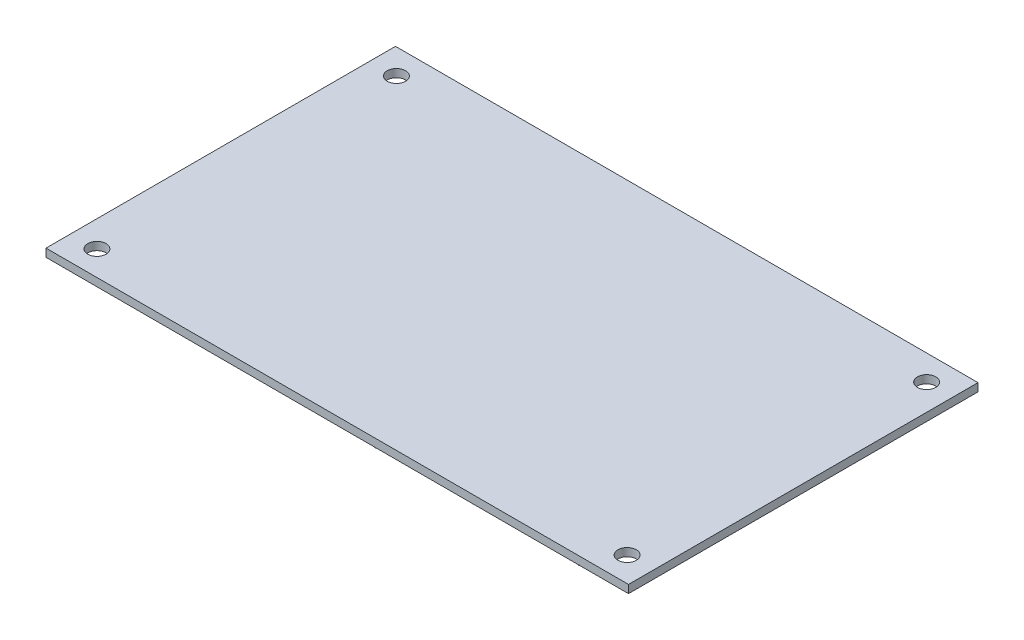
ISO-10303-21;
HEADER;
FILE_DESCRIPTION(('STEP AP214'),'2;1');
FILE_NAME('part.step','',(''),(''),'','','');
FILE_SCHEMA(('AUTOMOTIVE_DESIGN { 1 0 10303 214 1 1 1 1 }'));
ENDSEC;
DATA;
#1=APPLICATION_CONTEXT('core data for automotive mechanical design processes');
#2=APPLICATION_PROTOCOL_DEFINITION('international standard','automotive_design',2000,#1);
#3=PRODUCT_CONTEXT('',#1,'mechanical');
#4=PRODUCT('Part','Part','',(#3));
#5=PRODUCT_RELATED_PRODUCT_CATEGORY('part','',(#4));
#6=PRODUCT_DEFINITION_FORMATION('','',#4);
#7=PRODUCT_DEFINITION_CONTEXT('part definition',#1,'design');
#8=PRODUCT_DEFINITION('design','',#6,#7);
#9=PRODUCT_DEFINITION_SHAPE('','',#8);
#10=(LENGTH_UNIT() NAMED_UNIT(*) SI_UNIT(.MILLI.,.METRE.));
#11=(NAMED_UNIT(*) PLANE_ANGLE_UNIT() SI_UNIT($,.RADIAN.));
#12=(NAMED_UNIT(*) SI_UNIT($,.STERADIAN.) SOLID_ANGLE_UNIT());
#13=UNCERTAINTY_MEASURE_WITH_UNIT(LENGTH_MEASURE(1.E-05),#10,'distance_accuracy_value','');
#14=(GEOMETRIC_REPRESENTATION_CONTEXT(3) GLOBAL_UNCERTAINTY_ASSIGNED_CONTEXT((#13)) GLOBAL_UNIT_ASSIGNED_CONTEXT((#10,
#11,#12)) REPRESENTATION_CONTEXT('',''));
#15=CARTESIAN_POINT('',(0.,0.,0.));
#16=DIRECTION('',(0.,0.,1.));
#17=DIRECTION('',(1.,0.,0.));
#18=AXIS2_PLACEMENT_3D('',#15,#16,#17);
#19=CARTESIAN_POINT('',(11.2904395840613,-2.5,-26.600925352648));
#20=DIRECTION('',(0.,1.,0.));
#21=DIRECTION('',(0.,0.,1.));
#22=AXIS2_PLACEMENT_3D('',#19,#20,#21);
#23=CYLINDRICAL_SURFACE('',#22,0.199999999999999);
#24=CARTESIAN_POINT('',(11.2904395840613,0.,-26.600925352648));
#25=DIRECTION('',(0.,1.,0.));
#26=DIRECTION('',(0.,0.,1.));
#27=AXIS2_PLACEMENT_3D('',#24,#25,#26);
#28=CIRCLE('',#27,0.199999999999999);
#29=CARTESIAN_POINT('',(11.2904395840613,0.,-26.400925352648));
#30=VERTEX_POINT('',#29);
#31=EDGE_CURVE('E89',#30,#30,#28,.T.);
#32=ORIENTED_EDGE('',*,*,#31,.F.);
#33=EDGE_LOOP('',(#32));
#34=FACE_BOUND('',#33,.T.);
#35=CARTESIAN_POINT('',(11.2904395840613,-2.5,-26.600925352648));
#36=DIRECTION('',(0.,1.,0.));
#37=DIRECTION('',(0.,0.,1.));
#38=AXIS2_PLACEMENT_3D('',#35,#36,#37);
#39=CIRCLE('',#38,0.199999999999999);
#40=CARTESIAN_POINT('',(11.2904395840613,-2.5,-26.400925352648));
#41=VERTEX_POINT('',#40);
#42=EDGE_CURVE('E11',#41,#41,#39,.T.);
#43=ORIENTED_EDGE('',*,*,#42,.T.);
#44=EDGE_LOOP('',(#43));
#45=FACE_BOUND('',#44,.T.);
#46=ADVANCED_FACE('F17',(#34,#45),#23,.T.);
#47=CARTESIAN_POINT('',(11.2904395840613,-2.5,-28.4309421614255));
#48=DIRECTION('',(0.,1.,0.));
#49=DIRECTION('',(0.,0.,1.));
#50=AXIS2_PLACEMENT_3D('',#47,#48,#49);
#51=CYLINDRICAL_SURFACE('',#50,0.199999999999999);
#52=CARTESIAN_POINT('',(11.2904395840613,0.,-28.4309421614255));
#53=DIRECTION('',(0.,1.,0.));
#54=DIRECTION('',(0.,0.,1.));
#55=AXIS2_PLACEMENT_3D('',#52,#53,#54);
#56=CIRCLE('',#55,0.199999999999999);
#57=CARTESIAN_POINT('',(11.2904395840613,0.,-28.2309421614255));
#58=VERTEX_POINT('',#57);
#59=EDGE_CURVE('E487',#58,#58,#56,.T.);
#60=ORIENTED_EDGE('',*,*,#59,.F.);
#61=EDGE_LOOP('',(#60));
#62=FACE_BOUND('',#61,.T.);
#63=CARTESIAN_POINT('',(11.2904395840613,-2.5,-28.4309421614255));
#64=DIRECTION('',(0.,1.,0.));
#65=DIRECTION('',(0.,0.,1.));
#66=AXIS2_PLACEMENT_3D('',#63,#64,#65);
#67=CIRCLE('',#66,0.199999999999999);
#68=CARTESIAN_POINT('',(11.2904395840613,-2.5,-28.2309421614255));
#69=VERTEX_POINT('',#68);
#70=EDGE_CURVE('E27',#69,#69,#67,.T.);
#71=ORIENTED_EDGE('',*,*,#70,.T.);
#72=EDGE_LOOP('',(#71));
#73=FACE_BOUND('',#72,.T.);
#74=ADVANCED_FACE('F501',(#62,#73),#51,.T.);
#75=CARTESIAN_POINT('',(11.2904395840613,-2.5,-31.3896922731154));
#76=DIRECTION('',(0.,1.,0.));
#77=DIRECTION('',(0.,0.,1.));
#78=AXIS2_PLACEMENT_3D('',#75,#76,#77);
#79=CYLINDRICAL_SURFACE('',#78,0.199999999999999);
#80=CARTESIAN_POINT('',(11.2904395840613,0.,-31.3896922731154));
#81=DIRECTION('',(0.,1.,0.));
#82=DIRECTION('',(0.,0.,1.));
#83=AXIS2_PLACEMENT_3D('',#80,#81,#82);
#84=CIRCLE('',#83,0.199999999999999);
#85=CARTESIAN_POINT('',(11.2904395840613,0.,-31.1896922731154));
#86=VERTEX_POINT('',#85);
#87=EDGE_CURVE('E481',#86,#86,#84,.T.);
#88=ORIENTED_EDGE('',*,*,#87,.F.);
#89=EDGE_LOOP('',(#88));
#90=FACE_BOUND('',#89,.T.);
#91=CARTESIAN_POINT('',(11.2904395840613,-2.5,-31.3896922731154));
#92=DIRECTION('',(0.,1.,0.));
#93=DIRECTION('',(0.,0.,1.));
#94=AXIS2_PLACEMENT_3D('',#91,#92,#93);
#95=CIRCLE('',#94,0.199999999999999);
#96=CARTESIAN_POINT('',(11.2904395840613,-2.5,-31.1896922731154));
#97=VERTEX_POINT('',#96);
#98=EDGE_CURVE('E484',#97,#97,#95,.T.);
#99=ORIENTED_EDGE('',*,*,#98,.T.);
#100=EDGE_LOOP('',(#99));
#101=FACE_BOUND('',#100,.T.);
#102=ADVANCED_FACE('F1041',(#90,#101),#79,.T.);
#103=CARTESIAN_POINT('',(11.2904395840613,-2.5,-33.1842369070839));
#104=DIRECTION('',(0.,1.,0.));
#105=DIRECTION('',(0.,0.,1.));
#106=AXIS2_PLACEMENT_3D('',#103,#104,#105);
#107=CYLINDRICAL_SURFACE('',#106,0.199999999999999);
#108=CARTESIAN_POINT('',(11.2904395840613,0.,-33.1842369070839));
#109=DIRECTION('',(0.,1.,0.));
#110=DIRECTION('',(0.,0.,1.));
#111=AXIS2_PLACEMENT_3D('',#108,#109,#110);
#112=CIRCLE('',#111,0.199999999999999);
#113=CARTESIAN_POINT('',(11.2904395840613,0.,-32.9842369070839));
#114=VERTEX_POINT('',#113);
#115=EDGE_CURVE('E475',#114,#114,#112,.T.);
#116=ORIENTED_EDGE('',*,*,#115,.F.);
#117=EDGE_LOOP('',(#116));
#118=FACE_BOUND('',#117,.T.);
#119=CARTESIAN_POINT('',(11.2904395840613,-2.5,-33.1842369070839));
#120=DIRECTION('',(0.,1.,0.));
#121=DIRECTION('',(0.,0.,1.));
#122=AXIS2_PLACEMENT_3D('',#119,#120,#121);
#123=CIRCLE('',#122,0.199999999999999);
#124=CARTESIAN_POINT('',(11.2904395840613,-2.5,-32.9842369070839));
#125=VERTEX_POINT('',#124);
#126=EDGE_CURVE('E478',#125,#125,#123,.T.);
#127=ORIENTED_EDGE('',*,*,#126,.T.);
#128=EDGE_LOOP('',(#127));
#129=FACE_BOUND('',#128,.T.);
#130=ADVANCED_FACE('F1037',(#118,#129),#107,.T.);
#131=CARTESIAN_POINT('',(1.81181803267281,-2.5,-33.1842369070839));
#132=DIRECTION('',(0.,1.,0.));
#133=DIRECTION('',(0.,0.,1.));
#134=AXIS2_PLACEMENT_3D('',#131,#132,#133);
#135=CYLINDRICAL_SURFACE('',#134,0.199999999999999);
#136=CARTESIAN_POINT('',(1.81181803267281,0.,-33.1842369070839));
#137=DIRECTION('',(0.,1.,0.));
#138=DIRECTION('',(0.,0.,1.));
#139=AXIS2_PLACEMENT_3D('',#136,#137,#138);
#140=CIRCLE('',#139,0.199999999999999);
#141=CARTESIAN_POINT('',(1.81181803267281,0.,-32.9842369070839));
#142=VERTEX_POINT('',#141);
#143=EDGE_CURVE('E469',#142,#142,#140,.T.);
#144=ORIENTED_EDGE('',*,*,#143,.F.);
#145=EDGE_LOOP('',(#144));
#146=FACE_BOUND('',#145,.T.);
#147=CARTESIAN_POINT('',(1.81181803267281,-2.5,-33.1842369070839));
#148=DIRECTION('',(0.,1.,0.));
#149=DIRECTION('',(0.,0.,1.));
#150=AXIS2_PLACEMENT_3D('',#147,#148,#149);
#151=CIRCLE('',#150,0.199999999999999);
#152=CARTESIAN_POINT('',(1.81181803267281,-2.5,-32.9842369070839));
#153=VERTEX_POINT('',#152);
#154=EDGE_CURVE('E472',#153,#153,#151,.T.);
#155=ORIENTED_EDGE('',*,*,#154,.T.);
#156=EDGE_LOOP('',(#155));
#157=FACE_BOUND('',#156,.T.);
#158=ADVANCED_FACE('F1033',(#146,#157),#135,.T.);
#159=CARTESIAN_POINT('',(1.81181803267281,-2.5,-31.3896922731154));
#160=DIRECTION('',(0.,1.,0.));
#161=DIRECTION('',(0.,0.,1.));
#162=AXIS2_PLACEMENT_3D('',#159,#160,#161);
#163=CYLINDRICAL_SURFACE('',#162,0.199999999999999);
#164=CARTESIAN_POINT('',(1.81181803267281,0.,-31.3896922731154));
#165=DIRECTION('',(0.,1.,0.));
#166=DIRECTION('',(0.,0.,1.));
#167=AXIS2_PLACEMENT_3D('',#164,#165,#166);
#168=CIRCLE('',#167,0.199999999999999);
#169=CARTESIAN_POINT('',(1.81181803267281,0.,-31.1896922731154));
#170=VERTEX_POINT('',#169);
#171=EDGE_CURVE('E463',#170,#170,#168,.T.);
#172=ORIENTED_EDGE('',*,*,#171,.F.);
#173=EDGE_LOOP('',(#172));
#174=FACE_BOUND('',#173,.T.);
#175=CARTESIAN_POINT('',(1.81181803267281,-2.5,-31.3896922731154));
#176=DIRECTION('',(0.,1.,0.));
#177=DIRECTION('',(0.,0.,1.));
#178=AXIS2_PLACEMENT_3D('',#175,#176,#177);
#179=CIRCLE('',#178,0.199999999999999);
#180=CARTESIAN_POINT('',(1.81181803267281,-2.5,-31.1896922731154));
#181=VERTEX_POINT('',#180);
#182=EDGE_CURVE('E466',#181,#181,#179,.T.);
#183=ORIENTED_EDGE('',*,*,#182,.T.);
#184=EDGE_LOOP('',(#183));
#185=FACE_BOUND('',#184,.T.);
#186=ADVANCED_FACE('F1029',(#174,#185),#163,.T.);
#187=CARTESIAN_POINT('',(1.81181803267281,-2.5,-28.4309421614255));
#188=DIRECTION('',(0.,1.,0.));
#189=DIRECTION('',(0.,0.,1.));
#190=AXIS2_PLACEMENT_3D('',#187,#188,#189);
#191=CYLINDRICAL_SURFACE('',#190,0.199999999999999);
#192=CARTESIAN_POINT('',(1.81181803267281,0.,-28.4309421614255));
#193=DIRECTION('',(0.,1.,0.));
#194=DIRECTION('',(0.,0.,1.));
#195=AXIS2_PLACEMENT_3D('',#192,#193,#194);
#196=CIRCLE('',#195,0.199999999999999);
#197=CARTESIAN_POINT('',(1.81181803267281,0.,-28.2309421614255));
#198=VERTEX_POINT('',#197);
#199=EDGE_CURVE('E457',#198,#198,#196,.T.);
#200=ORIENTED_EDGE('',*,*,#199,.F.);
#201=EDGE_LOOP('',(#200));
#202=FACE_BOUND('',#201,.T.);
#203=CARTESIAN_POINT('',(1.81181803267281,-2.5,-28.4309421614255));
#204=DIRECTION('',(0.,1.,0.));
#205=DIRECTION('',(0.,0.,1.));
#206=AXIS2_PLACEMENT_3D('',#203,#204,#205);
#207=CIRCLE('',#206,0.199999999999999);
#208=CARTESIAN_POINT('',(1.81181803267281,-2.5,-28.2309421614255));
#209=VERTEX_POINT('',#208);
#210=EDGE_CURVE('E460',#209,#209,#207,.T.);
#211=ORIENTED_EDGE('',*,*,#210,.T.);
#212=EDGE_LOOP('',(#211));
#213=FACE_BOUND('',#212,.T.);
#214=ADVANCED_FACE('F1025',(#202,#213),#191,.T.);
#215=CARTESIAN_POINT('',(1.81181803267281,-2.5,-26.600925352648));
#216=DIRECTION('',(0.,1.,0.));
#217=DIRECTION('',(0.,0.,1.));
#218=AXIS2_PLACEMENT_3D('',#215,#216,#217);
#219=CYLINDRICAL_SURFACE('',#218,0.199999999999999);
#220=CARTESIAN_POINT('',(1.81181803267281,0.,-26.600925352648));
#221=DIRECTION('',(0.,1.,0.));
#222=DIRECTION('',(0.,0.,1.));
#223=AXIS2_PLACEMENT_3D('',#220,#221,#222);
#224=CIRCLE('',#223,0.199999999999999);
#225=CARTESIAN_POINT('',(1.81181803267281,0.,-26.400925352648));
#226=VERTEX_POINT('',#225);
#227=EDGE_CURVE('E451',#226,#226,#224,.T.);
#228=ORIENTED_EDGE('',*,*,#227,.F.);
#229=EDGE_LOOP('',(#228));
#230=FACE_BOUND('',#229,.T.);
#231=CARTESIAN_POINT('',(1.81181803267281,-2.5,-26.600925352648));
#232=DIRECTION('',(0.,1.,0.));
#233=DIRECTION('',(0.,0.,1.));
#234=AXIS2_PLACEMENT_3D('',#231,#232,#233);
#235=CIRCLE('',#234,0.199999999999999);
#236=CARTESIAN_POINT('',(1.81181803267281,-2.5,-26.400925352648));
#237=VERTEX_POINT('',#236);
#238=EDGE_CURVE('E454',#237,#237,#235,.T.);
#239=ORIENTED_EDGE('',*,*,#238,.T.);
#240=EDGE_LOOP('',(#239));
#241=FACE_BOUND('',#240,.T.);
#242=ADVANCED_FACE('F1021',(#230,#241),#219,.T.);
#243=CARTESIAN_POINT('',(-22.0121285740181,-2.5,-16.1107036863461));
#244=DIRECTION('',(0.,1.,0.));
#245=DIRECTION('',(0.,0.,1.));
#246=AXIS2_PLACEMENT_3D('',#243,#244,#245);
#247=CYLINDRICAL_SURFACE('',#246,0.199999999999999);
#248=CARTESIAN_POINT('',(-22.0121285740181,0.,-16.1107036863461));
#249=DIRECTION('',(0.,1.,0.));
#250=DIRECTION('',(0.,0.,1.));
#251=AXIS2_PLACEMENT_3D('',#248,#249,#250);
#252=CIRCLE('',#251,0.199999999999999);
#253=CARTESIAN_POINT('',(-22.0121285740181,0.,-15.9107036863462));
#254=VERTEX_POINT('',#253);
#255=EDGE_CURVE('E445',#254,#254,#252,.T.);
#256=ORIENTED_EDGE('',*,*,#255,.F.);
#257=EDGE_LOOP('',(#256));
#258=FACE_BOUND('',#257,.T.);
#259=CARTESIAN_POINT('',(-22.0121285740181,-2.5,-16.1107036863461));
#260=DIRECTION('',(0.,1.,0.));
#261=DIRECTION('',(0.,0.,1.));
#262=AXIS2_PLACEMENT_3D('',#259,#260,#261);
#263=CIRCLE('',#262,0.199999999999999);
#264=CARTESIAN_POINT('',(-22.0121285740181,-2.5,-15.9107036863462));
#265=VERTEX_POINT('',#264);
#266=EDGE_CURVE('E448',#265,#265,#263,.T.);
#267=ORIENTED_EDGE('',*,*,#266,.T.);
#268=EDGE_LOOP('',(#267));
#269=FACE_BOUND('',#268,.T.);
#270=ADVANCED_FACE('F1017',(#258,#269),#247,.T.);
#271=CARTESIAN_POINT('',(-26.9897284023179,-2.5,-16.1107036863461));
#272=DIRECTION('',(0.,1.,0.));
#273=DIRECTION('',(0.,0.,1.));
#274=AXIS2_PLACEMENT_3D('',#271,#272,#273);
#275=CYLINDRICAL_SURFACE('',#274,0.199999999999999);
#276=CARTESIAN_POINT('',(-26.9897284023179,0.,-16.1107036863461));
#277=DIRECTION('',(0.,1.,0.));
#278=DIRECTION('',(0.,0.,1.));
#279=AXIS2_PLACEMENT_3D('',#276,#277,#278);
#280=CIRCLE('',#279,0.199999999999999);
#281=CARTESIAN_POINT('',(-26.9897284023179,0.,-15.9107036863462));
#282=VERTEX_POINT('',#281);
#283=EDGE_CURVE('E439',#282,#282,#280,.T.);
#284=ORIENTED_EDGE('',*,*,#283,.F.);
#285=EDGE_LOOP('',(#284));
#286=FACE_BOUND('',#285,.T.);
#287=CARTESIAN_POINT('',(-26.9897284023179,-2.5,-16.1107036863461));
#288=DIRECTION('',(0.,1.,0.));
#289=DIRECTION('',(0.,0.,1.));
#290=AXIS2_PLACEMENT_3D('',#287,#288,#289);
#291=CIRCLE('',#290,0.199999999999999);
#292=CARTESIAN_POINT('',(-26.9897284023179,-2.5,-15.9107036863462));
#293=VERTEX_POINT('',#292);
#294=EDGE_CURVE('E442',#293,#293,#291,.T.);
#295=ORIENTED_EDGE('',*,*,#294,.T.);
#296=EDGE_LOOP('',(#295));
#297=FACE_BOUND('',#296,.T.);
#298=ADVANCED_FACE('F1013',(#286,#297),#275,.T.);
#299=CARTESIAN_POINT('',(-30.0298645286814,-2.5,-17.6451021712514));
#300=DIRECTION('',(0.,1.,0.));
#301=DIRECTION('',(0.,0.,1.));
#302=AXIS2_PLACEMENT_3D('',#299,#300,#301);
#303=CYLINDRICAL_SURFACE('',#302,0.199999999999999);
#304=CARTESIAN_POINT('',(-30.0298645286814,0.,-17.6451021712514));
#305=DIRECTION('',(0.,1.,0.));
#306=DIRECTION('',(0.,0.,1.));
#307=AXIS2_PLACEMENT_3D('',#304,#305,#306);
#308=CIRCLE('',#307,0.199999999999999);
#309=CARTESIAN_POINT('',(-30.0298645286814,0.,-17.4451021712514));
#310=VERTEX_POINT('',#309);
#311=EDGE_CURVE('E433',#310,#310,#308,.T.);
#312=ORIENTED_EDGE('',*,*,#311,.F.);
#313=EDGE_LOOP('',(#312));
#314=FACE_BOUND('',#313,.T.);
#315=CARTESIAN_POINT('',(-30.0298645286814,-2.5,-17.6451021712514));
#316=DIRECTION('',(0.,1.,0.));
#317=DIRECTION('',(0.,0.,1.));
#318=AXIS2_PLACEMENT_3D('',#315,#316,#317);
#319=CIRCLE('',#318,0.199999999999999);
#320=CARTESIAN_POINT('',(-30.0298645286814,-2.5,-17.4451021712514));
#321=VERTEX_POINT('',#320);
#322=EDGE_CURVE('E436',#321,#321,#319,.T.);
#323=ORIENTED_EDGE('',*,*,#322,.T.);
#324=EDGE_LOOP('',(#323));
#325=FACE_BOUND('',#324,.T.);
#326=ADVANCED_FACE('F1009',(#314,#325),#303,.T.);
#327=CARTESIAN_POINT('',(-33.1490718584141,-2.5,-20.9976915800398));
#328=DIRECTION('',(0.,1.,0.));
#329=DIRECTION('',(0.,0.,1.));
#330=AXIS2_PLACEMENT_3D('',#327,#328,#329);
#331=CYLINDRICAL_SURFACE('',#330,0.199999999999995);
#332=CARTESIAN_POINT('',(-33.1490718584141,0.,-20.9976915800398));
#333=DIRECTION('',(0.,1.,0.));
#334=DIRECTION('',(0.,0.,1.));
#335=AXIS2_PLACEMENT_3D('',#332,#333,#334);
#336=CIRCLE('',#335,0.199999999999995);
#337=CARTESIAN_POINT('',(-33.1490718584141,0.,-20.7976915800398));
#338=VERTEX_POINT('',#337);
#339=EDGE_CURVE('E427',#338,#338,#336,.T.);
#340=ORIENTED_EDGE('',*,*,#339,.F.);
#341=EDGE_LOOP('',(#340));
#342=FACE_BOUND('',#341,.T.);
#343=CARTESIAN_POINT('',(-33.1490718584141,-2.5,-20.9976915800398));
#344=DIRECTION('',(0.,1.,0.));
#345=DIRECTION('',(0.,0.,1.));
#346=AXIS2_PLACEMENT_3D('',#343,#344,#345);
#347=CIRCLE('',#346,0.199999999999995);
#348=CARTESIAN_POINT('',(-33.1490718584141,-2.5,-20.7976915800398));
#349=VERTEX_POINT('',#348);
#350=EDGE_CURVE('E430',#349,#349,#347,.T.);
#351=ORIENTED_EDGE('',*,*,#350,.T.);
#352=EDGE_LOOP('',(#351));
#353=FACE_BOUND('',#352,.T.);
#354=ADVANCED_FACE('F1005',(#342,#353),#331,.T.);
#355=CARTESIAN_POINT('',(-35.0221662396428,-2.5,-17.6451021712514));
#356=DIRECTION('',(0.,1.,0.));
#357=DIRECTION('',(0.,0.,1.));
#358=AXIS2_PLACEMENT_3D('',#355,#356,#357);
#359=CYLINDRICAL_SURFACE('',#358,0.199999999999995);
#360=CARTESIAN_POINT('',(-35.0221662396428,0.,-17.6451021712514));
#361=DIRECTION('',(0.,1.,0.));
#362=DIRECTION('',(0.,0.,1.));
#363=AXIS2_PLACEMENT_3D('',#360,#361,#362);
#364=CIRCLE('',#363,0.199999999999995);
#365=CARTESIAN_POINT('',(-35.0221662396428,0.,-17.4451021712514));
#366=VERTEX_POINT('',#365);
#367=EDGE_CURVE('E421',#366,#366,#364,.T.);
#368=ORIENTED_EDGE('',*,*,#367,.F.);
#369=EDGE_LOOP('',(#368));
#370=FACE_BOUND('',#369,.T.);
#371=CARTESIAN_POINT('',(-35.0221662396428,-2.5,-17.6451021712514));
#372=DIRECTION('',(0.,1.,0.));
#373=DIRECTION('',(0.,0.,1.));
#374=AXIS2_PLACEMENT_3D('',#371,#372,#373);
#375=CIRCLE('',#374,0.199999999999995);
#376=CARTESIAN_POINT('',(-35.0221662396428,-2.5,-17.4451021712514));
#377=VERTEX_POINT('',#376);
#378=EDGE_CURVE('E424',#377,#377,#375,.T.);
#379=ORIENTED_EDGE('',*,*,#378,.T.);
#380=EDGE_LOOP('',(#379));
#381=FACE_BOUND('',#380,.T.);
#382=ADVANCED_FACE('F1001',(#370,#381),#359,.T.);
#383=CARTESIAN_POINT('',(-36.6490718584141,-2.5,-20.9976915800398));
#384=DIRECTION('',(0.,1.,0.));
#385=DIRECTION('',(0.,0.,1.));
#386=AXIS2_PLACEMENT_3D('',#383,#384,#385);
#387=CYLINDRICAL_SURFACE('',#386,0.199999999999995);
#388=CARTESIAN_POINT('',(-36.6490718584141,0.,-20.9976915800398));
#389=DIRECTION('',(0.,1.,0.));
#390=DIRECTION('',(0.,0.,1.));
#391=AXIS2_PLACEMENT_3D('',#388,#389,#390);
#392=CIRCLE('',#391,0.199999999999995);
#393=CARTESIAN_POINT('',(-36.6490718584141,0.,-20.7976915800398));
#394=VERTEX_POINT('',#393);
#395=EDGE_CURVE('E415',#394,#394,#392,.T.);
#396=ORIENTED_EDGE('',*,*,#395,.F.);
#397=EDGE_LOOP('',(#396));
#398=FACE_BOUND('',#397,.T.);
#399=CARTESIAN_POINT('',(-36.6490718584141,-2.5,-20.9976915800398));
#400=DIRECTION('',(0.,1.,0.));
#401=DIRECTION('',(0.,0.,1.));
#402=AXIS2_PLACEMENT_3D('',#399,#400,#401);
#403=CIRCLE('',#402,0.199999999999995);
#404=CARTESIAN_POINT('',(-36.6490718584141,-2.5,-20.7976915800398));
#405=VERTEX_POINT('',#404);
#406=EDGE_CURVE('E418',#405,#405,#403,.T.);
#407=ORIENTED_EDGE('',*,*,#406,.T.);
#408=EDGE_LOOP('',(#407));
#409=FACE_BOUND('',#408,.T.);
#410=ADVANCED_FACE('F997',(#398,#409),#387,.T.);
#411=CARTESIAN_POINT('',(-36.6833954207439,-2.5,-15.5082012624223));
#412=DIRECTION('',(0.,1.,0.));
#413=DIRECTION('',(0.,0.,1.));
#414=AXIS2_PLACEMENT_3D('',#411,#412,#413);
#415=CYLINDRICAL_SURFACE('',#414,0.199999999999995);
#416=CARTESIAN_POINT('',(-36.6833954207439,0.,-15.5082012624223));
#417=DIRECTION('',(0.,1.,0.));
#418=DIRECTION('',(0.,0.,1.));
#419=AXIS2_PLACEMENT_3D('',#416,#417,#418);
#420=CIRCLE('',#419,0.199999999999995);
#421=CARTESIAN_POINT('',(-36.6833954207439,0.,-15.3082012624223));
#422=VERTEX_POINT('',#421);
#423=EDGE_CURVE('E409',#422,#422,#420,.T.);
#424=ORIENTED_EDGE('',*,*,#423,.F.);
#425=EDGE_LOOP('',(#424));
#426=FACE_BOUND('',#425,.T.);
#427=CARTESIAN_POINT('',(-36.6833954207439,-2.5,-15.5082012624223));
#428=DIRECTION('',(0.,1.,0.));
#429=DIRECTION('',(0.,0.,1.));
#430=AXIS2_PLACEMENT_3D('',#427,#428,#429);
#431=CIRCLE('',#430,0.199999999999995);
#432=CARTESIAN_POINT('',(-36.6833954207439,-2.5,-15.3082012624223));
#433=VERTEX_POINT('',#432);
#434=EDGE_CURVE('E412',#433,#433,#431,.T.);
#435=ORIENTED_EDGE('',*,*,#434,.T.);
#436=EDGE_LOOP('',(#435));
#437=FACE_BOUND('',#436,.T.);
#438=ADVANCED_FACE('F993',(#426,#437),#415,.T.);
#439=CARTESIAN_POINT('',(-41.6506920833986,-2.5,-15.5394973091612));
#440=DIRECTION('',(0.,1.,0.));
#441=DIRECTION('',(0.,0.,1.));
#442=AXIS2_PLACEMENT_3D('',#439,#440,#441);
#443=CYLINDRICAL_SURFACE('',#442,0.199999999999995);
#444=CARTESIAN_POINT('',(-41.6506920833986,0.,-15.5394973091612));
#445=DIRECTION('',(0.,1.,0.));
#446=DIRECTION('',(0.,0.,1.));
#447=AXIS2_PLACEMENT_3D('',#444,#445,#446);
#448=CIRCLE('',#447,0.199999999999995);
#449=CARTESIAN_POINT('',(-41.6506920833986,0.,-15.3394973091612));
#450=VERTEX_POINT('',#449);
#451=EDGE_CURVE('E403',#450,#450,#448,.T.);
#452=ORIENTED_EDGE('',*,*,#451,.F.);
#453=EDGE_LOOP('',(#452));
#454=FACE_BOUND('',#453,.T.);
#455=CARTESIAN_POINT('',(-41.6506920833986,-2.5,-15.5394973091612));
#456=DIRECTION('',(0.,1.,0.));
#457=DIRECTION('',(0.,0.,1.));
#458=AXIS2_PLACEMENT_3D('',#455,#456,#457);
#459=CIRCLE('',#458,0.199999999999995);
#460=CARTESIAN_POINT('',(-41.6506920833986,-2.5,-15.3394973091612));
#461=VERTEX_POINT('',#460);
#462=EDGE_CURVE('E406',#461,#461,#459,.T.);
#463=ORIENTED_EDGE('',*,*,#462,.T.);
#464=EDGE_LOOP('',(#463));
#465=FACE_BOUND('',#464,.T.);
#466=ADVANCED_FACE('F989',(#454,#465),#443,.T.);
#467=CARTESIAN_POINT('',(-51.2250411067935,-2.5,-35.450257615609));
#468=DIRECTION('',(0.,1.,0.));
#469=DIRECTION('',(0.,0.,1.));
#470=AXIS2_PLACEMENT_3D('',#467,#468,#469);
#471=CYLINDRICAL_SURFACE('',#470,0.199999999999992);
#472=CARTESIAN_POINT('',(-51.2250411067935,0.,-35.450257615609));
#473=DIRECTION('',(0.,1.,0.));
#474=DIRECTION('',(0.,0.,1.));
#475=AXIS2_PLACEMENT_3D('',#472,#473,#474);
#476=CIRCLE('',#475,0.199999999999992);
#477=CARTESIAN_POINT('',(-51.2250411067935,0.,-35.250257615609));
#478=VERTEX_POINT('',#477);
#479=EDGE_CURVE('E397',#478,#478,#476,.T.);
#480=ORIENTED_EDGE('',*,*,#479,.F.);
#481=EDGE_LOOP('',(#480));
#482=FACE_BOUND('',#481,.T.);
#483=CARTESIAN_POINT('',(-51.2250411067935,-2.5,-35.450257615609));
#484=DIRECTION('',(0.,1.,0.));
#485=DIRECTION('',(0.,0.,1.));
#486=AXIS2_PLACEMENT_3D('',#483,#484,#485);
#487=CIRCLE('',#486,0.199999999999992);
#488=CARTESIAN_POINT('',(-51.2250411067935,-2.5,-35.250257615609));
#489=VERTEX_POINT('',#488);
#490=EDGE_CURVE('E400',#489,#489,#487,.T.);
#491=ORIENTED_EDGE('',*,*,#490,.T.);
#492=EDGE_LOOP('',(#491));
#493=FACE_BOUND('',#492,.T.);
#494=ADVANCED_FACE('F985',(#482,#493),#471,.T.);
#495=CARTESIAN_POINT('',(-55.0037665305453,-2.5,-28.8809446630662));
#496=DIRECTION('',(0.,1.,0.));
#497=DIRECTION('',(0.,0.,1.));
#498=AXIS2_PLACEMENT_3D('',#495,#496,#497);
#499=CYLINDRICAL_SURFACE('',#498,0.199999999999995);
#500=CARTESIAN_POINT('',(-55.0037665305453,0.,-28.8809446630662));
#501=DIRECTION('',(0.,1.,0.));
#502=DIRECTION('',(0.,0.,1.));
#503=AXIS2_PLACEMENT_3D('',#500,#501,#502);
#504=CIRCLE('',#503,0.199999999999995);
#505=CARTESIAN_POINT('',(-55.0037665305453,0.,-28.6809446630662));
#506=VERTEX_POINT('',#505);
#507=EDGE_CURVE('E391',#506,#506,#504,.T.);
#508=ORIENTED_EDGE('',*,*,#507,.F.);
#509=EDGE_LOOP('',(#508));
#510=FACE_BOUND('',#509,.T.);
#511=CARTESIAN_POINT('',(-55.0037665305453,-2.5,-28.8809446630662));
#512=DIRECTION('',(0.,1.,0.));
#513=DIRECTION('',(0.,0.,1.));
#514=AXIS2_PLACEMENT_3D('',#511,#512,#513);
#515=CIRCLE('',#514,0.199999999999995);
#516=CARTESIAN_POINT('',(-55.0037665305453,-2.5,-28.6809446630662));
#517=VERTEX_POINT('',#516);
#518=EDGE_CURVE('E394',#517,#517,#515,.T.);
#519=ORIENTED_EDGE('',*,*,#518,.T.);
#520=EDGE_LOOP('',(#519));
#521=FACE_BOUND('',#520,.T.);
#522=ADVANCED_FACE('F981',(#510,#521),#499,.T.);
#523=CARTESIAN_POINT('',(-50.5098128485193,-2.5,-26.1912852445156));
#524=DIRECTION('',(0.,1.,0.));
#525=DIRECTION('',(0.,0.,1.));
#526=AXIS2_PLACEMENT_3D('',#523,#524,#525);
#527=CYLINDRICAL_SURFACE('',#526,0.199999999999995);
#528=CARTESIAN_POINT('',(-50.5098128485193,0.,-26.1912852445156));
#529=DIRECTION('',(0.,1.,0.));
#530=DIRECTION('',(0.,0.,1.));
#531=AXIS2_PLACEMENT_3D('',#528,#529,#530);
#532=CIRCLE('',#531,0.199999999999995);
#533=CARTESIAN_POINT('',(-50.5098128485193,0.,-25.9912852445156));
#534=VERTEX_POINT('',#533);
#535=EDGE_CURVE('E385',#534,#534,#532,.T.);
#536=ORIENTED_EDGE('',*,*,#535,.F.);
#537=EDGE_LOOP('',(#536));
#538=FACE_BOUND('',#537,.T.);
#539=CARTESIAN_POINT('',(-50.5098128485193,-2.5,-26.1912852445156));
#540=DIRECTION('',(0.,1.,0.));
#541=DIRECTION('',(0.,0.,1.));
#542=AXIS2_PLACEMENT_3D('',#539,#540,#541);
#543=CIRCLE('',#542,0.199999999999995);
#544=CARTESIAN_POINT('',(-50.5098128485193,-2.5,-25.9912852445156));
#545=VERTEX_POINT('',#544);
#546=EDGE_CURVE('E388',#545,#545,#543,.T.);
#547=ORIENTED_EDGE('',*,*,#546,.T.);
#548=EDGE_LOOP('',(#547));
#549=FACE_BOUND('',#548,.T.);
#550=ADVANCED_FACE('F977',(#538,#549),#527,.T.);
#551=CARTESIAN_POINT('',(-60.8138069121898,-2.5,5.44187093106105));
#552=DIRECTION('',(0.,1.,0.));
#553=DIRECTION('',(0.,0.,1.));
#554=AXIS2_PLACEMENT_3D('',#551,#552,#553);
#555=CYLINDRICAL_SURFACE('',#554,0.199999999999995);
#556=CARTESIAN_POINT('',(-60.8138069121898,0.,5.44187093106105));
#557=DIRECTION('',(0.,1.,0.));
#558=DIRECTION('',(0.,0.,1.));
#559=AXIS2_PLACEMENT_3D('',#556,#557,#558);
#560=CIRCLE('',#559,0.199999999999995);
#561=CARTESIAN_POINT('',(-60.8138069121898,0.,5.64187093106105));
#562=VERTEX_POINT('',#561);
#563=EDGE_CURVE('E379',#562,#562,#560,.T.);
#564=ORIENTED_EDGE('',*,*,#563,.F.);
#565=EDGE_LOOP('',(#564));
#566=FACE_BOUND('',#565,.T.);
#567=CARTESIAN_POINT('',(-60.8138069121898,-2.5,5.44187093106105));
#568=DIRECTION('',(0.,1.,0.));
#569=DIRECTION('',(0.,0.,1.));
#570=AXIS2_PLACEMENT_3D('',#567,#568,#569);
#571=CIRCLE('',#570,0.199999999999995);
#572=CARTESIAN_POINT('',(-60.8138069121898,-2.5,5.64187093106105));
#573=VERTEX_POINT('',#572);
#574=EDGE_CURVE('E382',#573,#573,#571,.T.);
#575=ORIENTED_EDGE('',*,*,#574,.T.);
#576=EDGE_LOOP('',(#575));
#577=FACE_BOUND('',#576,.T.);
#578=ADVANCED_FACE('F973',(#566,#577),#555,.T.);
#579=CARTESIAN_POINT('',(-56.2964186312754,-2.5,8.13423434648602));
#580=DIRECTION('',(0.,1.,0.));
#581=DIRECTION('',(0.,0.,1.));
#582=AXIS2_PLACEMENT_3D('',#579,#580,#581);
#583=CYLINDRICAL_SURFACE('',#582,0.199999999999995);
#584=CARTESIAN_POINT('',(-56.2964186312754,0.,8.13423434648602));
#585=DIRECTION('',(0.,1.,0.));
#586=DIRECTION('',(0.,0.,1.));
#587=AXIS2_PLACEMENT_3D('',#584,#585,#586);
#588=CIRCLE('',#587,0.199999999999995);
#589=CARTESIAN_POINT('',(-56.2964186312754,0.,8.33423434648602));
#590=VERTEX_POINT('',#589);
#591=EDGE_CURVE('E373',#590,#590,#588,.T.);
#592=ORIENTED_EDGE('',*,*,#591,.F.);
#593=EDGE_LOOP('',(#592));
#594=FACE_BOUND('',#593,.T.);
#595=CARTESIAN_POINT('',(-56.2964186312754,-2.5,8.13423434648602));
#596=DIRECTION('',(0.,1.,0.));
#597=DIRECTION('',(0.,0.,1.));
#598=AXIS2_PLACEMENT_3D('',#595,#596,#597);
#599=CIRCLE('',#598,0.199999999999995);
#600=CARTESIAN_POINT('',(-56.2964186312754,-2.5,8.33423434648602));
#601=VERTEX_POINT('',#600);
#602=EDGE_CURVE('E376',#601,#601,#599,.T.);
#603=ORIENTED_EDGE('',*,*,#602,.T.);
#604=EDGE_LOOP('',(#603));
#605=FACE_BOUND('',#604,.T.);
#606=ADVANCED_FACE('F969',(#594,#605),#583,.T.);
#607=CARTESIAN_POINT('',(-47.4480133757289,-2.5,30.3062876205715));
#608=DIRECTION('',(0.,1.,0.));
#609=DIRECTION('',(0.,0.,1.));
#610=AXIS2_PLACEMENT_3D('',#607,#608,#609);
#611=CYLINDRICAL_SURFACE('',#610,0.199999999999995);
#612=CARTESIAN_POINT('',(-47.4480133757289,0.,30.3062876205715));
#613=DIRECTION('',(0.,1.,0.));
#614=DIRECTION('',(0.,0.,1.));
#615=AXIS2_PLACEMENT_3D('',#612,#613,#614);
#616=CIRCLE('',#615,0.199999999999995);
#617=CARTESIAN_POINT('',(-47.4480133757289,0.,30.5062876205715));
#618=VERTEX_POINT('',#617);
#619=EDGE_CURVE('E367',#618,#618,#616,.T.);
#620=ORIENTED_EDGE('',*,*,#619,.F.);
#621=EDGE_LOOP('',(#620));
#622=FACE_BOUND('',#621,.T.);
#623=CARTESIAN_POINT('',(-47.4480133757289,-2.5,30.3062876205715));
#624=DIRECTION('',(0.,1.,0.));
#625=DIRECTION('',(0.,0.,1.));
#626=AXIS2_PLACEMENT_3D('',#623,#624,#625);
#627=CIRCLE('',#626,0.199999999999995);
#628=CARTESIAN_POINT('',(-47.4480133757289,-2.5,30.5062876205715));
#629=VERTEX_POINT('',#628);
#630=EDGE_CURVE('E370',#629,#629,#627,.T.);
#631=ORIENTED_EDGE('',*,*,#630,.T.);
#632=EDGE_LOOP('',(#631));
#633=FACE_BOUND('',#632,.T.);
#634=ADVANCED_FACE('F965',(#622,#633),#611,.T.);
#635=CARTESIAN_POINT('',(-50.1457548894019,-2.5,34.8180277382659));
#636=DIRECTION('',(0.,1.,0.));
#637=DIRECTION('',(0.,0.,1.));
#638=AXIS2_PLACEMENT_3D('',#635,#636,#637);
#639=CYLINDRICAL_SURFACE('',#638,0.199999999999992);
#640=CARTESIAN_POINT('',(-50.1457548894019,0.,34.8180277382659));
#641=DIRECTION('',(0.,1.,0.));
#642=DIRECTION('',(0.,0.,1.));
#643=AXIS2_PLACEMENT_3D('',#640,#641,#642);
#644=CIRCLE('',#643,0.199999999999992);
#645=CARTESIAN_POINT('',(-50.1457548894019,0.,35.0180277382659));
#646=VERTEX_POINT('',#645);
#647=EDGE_CURVE('E361',#646,#646,#644,.T.);
#648=ORIENTED_EDGE('',*,*,#647,.F.);
#649=EDGE_LOOP('',(#648));
#650=FACE_BOUND('',#649,.T.);
#651=CARTESIAN_POINT('',(-50.1457548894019,-2.5,34.8180277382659));
#652=DIRECTION('',(0.,1.,0.));
#653=DIRECTION('',(0.,0.,1.));
#654=AXIS2_PLACEMENT_3D('',#651,#652,#653);
#655=CIRCLE('',#654,0.199999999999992);
#656=CARTESIAN_POINT('',(-50.1457548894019,-2.5,35.0180277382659));
#657=VERTEX_POINT('',#656);
#658=EDGE_CURVE('E364',#657,#657,#655,.T.);
#659=ORIENTED_EDGE('',*,*,#658,.T.);
#660=EDGE_LOOP('',(#659));
#661=FACE_BOUND('',#660,.T.);
#662=ADVANCED_FACE('F961',(#650,#661),#639,.T.);
#663=CARTESIAN_POINT('',(-38.5442853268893,-2.5,4.52105183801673));
#664=DIRECTION('',(0.,1.,0.));
#665=DIRECTION('',(0.,0.,1.));
#666=AXIS2_PLACEMENT_3D('',#663,#664,#665);
#667=CYLINDRICAL_SURFACE('',#666,0.199999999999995);
#668=CARTESIAN_POINT('',(-38.5442853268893,0.,4.52105183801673));
#669=DIRECTION('',(0.,1.,0.));
#670=DIRECTION('',(0.,0.,1.));
#671=AXIS2_PLACEMENT_3D('',#668,#669,#670);
#672=CIRCLE('',#671,0.199999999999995);
#673=CARTESIAN_POINT('',(-38.5442853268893,0.,4.72105183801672));
#674=VERTEX_POINT('',#673);
#675=EDGE_CURVE('E355',#674,#674,#672,.T.);
#676=ORIENTED_EDGE('',*,*,#675,.F.);
#677=EDGE_LOOP('',(#676));
#678=FACE_BOUND('',#677,.T.);
#679=CARTESIAN_POINT('',(-38.5442853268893,-2.5,4.52105183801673));
#680=DIRECTION('',(0.,1.,0.));
#681=DIRECTION('',(0.,0.,1.));
#682=AXIS2_PLACEMENT_3D('',#679,#680,#681);
#683=CIRCLE('',#682,0.199999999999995);
#684=CARTESIAN_POINT('',(-38.5442853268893,-2.5,4.72105183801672));
#685=VERTEX_POINT('',#684);
#686=EDGE_CURVE('E358',#685,#685,#683,.T.);
#687=ORIENTED_EDGE('',*,*,#686,.T.);
#688=EDGE_LOOP('',(#687));
#689=FACE_BOUND('',#688,.T.);
#690=ADVANCED_FACE('F957',(#678,#689),#667,.T.);
#691=CARTESIAN_POINT('',(-39.3422382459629,-2.5,11.4450494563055));
#692=DIRECTION('',(0.,1.,0.));
#693=DIRECTION('',(0.,0.,1.));
#694=AXIS2_PLACEMENT_3D('',#691,#692,#693);
#695=CYLINDRICAL_SURFACE('',#694,0.199999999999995);
#696=CARTESIAN_POINT('',(-39.3422382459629,0.,11.4450494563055));
#697=DIRECTION('',(0.,1.,0.));
#698=DIRECTION('',(0.,0.,1.));
#699=AXIS2_PLACEMENT_3D('',#696,#697,#698);
#700=CIRCLE('',#699,0.199999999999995);
#701=CARTESIAN_POINT('',(-39.3422382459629,0.,11.6450494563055));
#702=VERTEX_POINT('',#701);
#703=EDGE_CURVE('E349',#702,#702,#700,.T.);
#704=ORIENTED_EDGE('',*,*,#703,.F.);
#705=EDGE_LOOP('',(#704));
#706=FACE_BOUND('',#705,.T.);
#707=CARTESIAN_POINT('',(-39.3422382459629,-2.5,11.4450494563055));
#708=DIRECTION('',(0.,1.,0.));
#709=DIRECTION('',(0.,0.,1.));
#710=AXIS2_PLACEMENT_3D('',#707,#708,#709);
#711=CIRCLE('',#710,0.199999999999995);
#712=CARTESIAN_POINT('',(-39.3422382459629,-2.5,11.6450494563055));
#713=VERTEX_POINT('',#712);
#714=EDGE_CURVE('E352',#713,#713,#711,.T.);
#715=ORIENTED_EDGE('',*,*,#714,.T.);
#716=EDGE_LOOP('',(#715));
#717=FACE_BOUND('',#716,.T.);
#718=ADVANCED_FACE('F953',(#706,#717),#695,.T.);
#719=CARTESIAN_POINT('',(-26.3492800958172,-2.5,11.4450494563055));
#720=DIRECTION('',(0.,1.,0.));
#721=DIRECTION('',(0.,0.,1.));
#722=AXIS2_PLACEMENT_3D('',#719,#720,#721);
#723=CYLINDRICAL_SURFACE('',#722,0.199999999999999);
#724=CARTESIAN_POINT('',(-26.3492800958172,0.,11.4450494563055));
#725=DIRECTION('',(0.,1.,0.));
#726=DIRECTION('',(0.,0.,1.));
#727=AXIS2_PLACEMENT_3D('',#724,#725,#726);
#728=CIRCLE('',#727,0.199999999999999);
#729=CARTESIAN_POINT('',(-26.3492800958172,0.,11.6450494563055));
#730=VERTEX_POINT('',#729);
#731=EDGE_CURVE('E343',#730,#730,#728,.T.);
#732=ORIENTED_EDGE('',*,*,#731,.F.);
#733=EDGE_LOOP('',(#732));
#734=FACE_BOUND('',#733,.T.);
#735=CARTESIAN_POINT('',(-26.3492800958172,-2.5,11.4450494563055));
#736=DIRECTION('',(0.,1.,0.));
#737=DIRECTION('',(0.,0.,1.));
#738=AXIS2_PLACEMENT_3D('',#735,#736,#737);
#739=CIRCLE('',#738,0.199999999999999);
#740=CARTESIAN_POINT('',(-26.3492800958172,-2.5,11.6450494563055));
#741=VERTEX_POINT('',#740);
#742=EDGE_CURVE('E346',#741,#741,#739,.T.);
#743=ORIENTED_EDGE('',*,*,#742,.T.);
#744=EDGE_LOOP('',(#743));
#745=FACE_BOUND('',#744,.T.);
#746=ADVANCED_FACE('F949',(#734,#745),#723,.T.);
#747=CARTESIAN_POINT('',(-36.011120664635,-2.5,26.850904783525));
#748=DIRECTION('',(0.,1.,0.));
#749=DIRECTION('',(0.,0.,1.));
#750=AXIS2_PLACEMENT_3D('',#747,#748,#749);
#751=CYLINDRICAL_SURFACE('',#750,0.199999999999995);
#752=CARTESIAN_POINT('',(-36.011120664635,0.,26.850904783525));
#753=DIRECTION('',(0.,1.,0.));
#754=DIRECTION('',(0.,0.,1.));
#755=AXIS2_PLACEMENT_3D('',#752,#753,#754);
#756=CIRCLE('',#755,0.199999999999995);
#757=CARTESIAN_POINT('',(-36.011120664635,0.,27.050904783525));
#758=VERTEX_POINT('',#757);
#759=EDGE_CURVE('E337',#758,#758,#756,.T.);
#760=ORIENTED_EDGE('',*,*,#759,.F.);
#761=EDGE_LOOP('',(#760));
#762=FACE_BOUND('',#761,.T.);
#763=CARTESIAN_POINT('',(-36.011120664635,-2.5,26.850904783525));
#764=DIRECTION('',(0.,1.,0.));
#765=DIRECTION('',(0.,0.,1.));
#766=AXIS2_PLACEMENT_3D('',#763,#764,#765);
#767=CIRCLE('',#766,0.199999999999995);
#768=CARTESIAN_POINT('',(-36.011120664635,-2.5,27.050904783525));
#769=VERTEX_POINT('',#768);
#770=EDGE_CURVE('E340',#769,#769,#767,.T.);
#771=ORIENTED_EDGE('',*,*,#770,.T.);
#772=EDGE_LOOP('',(#771));
#773=FACE_BOUND('',#772,.T.);
#774=ADVANCED_FACE('F945',(#762,#773),#751,.T.);
#775=CARTESIAN_POINT('',(-36.011120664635,-2.5,23.9915461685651));
#776=DIRECTION('',(0.,1.,0.));
#777=DIRECTION('',(0.,0.,1.));
#778=AXIS2_PLACEMENT_3D('',#775,#776,#777);
#779=CYLINDRICAL_SURFACE('',#778,0.199999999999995);
#780=CARTESIAN_POINT('',(-36.011120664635,0.,23.9915461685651));
#781=DIRECTION('',(0.,1.,0.));
#782=DIRECTION('',(0.,0.,1.));
#783=AXIS2_PLACEMENT_3D('',#780,#781,#782);
#784=CIRCLE('',#783,0.199999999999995);
#785=CARTESIAN_POINT('',(-36.011120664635,0.,24.1915461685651));
#786=VERTEX_POINT('',#785);
#787=EDGE_CURVE('E331',#786,#786,#784,.T.);
#788=ORIENTED_EDGE('',*,*,#787,.F.);
#789=EDGE_LOOP('',(#788));
#790=FACE_BOUND('',#789,.T.);
#791=CARTESIAN_POINT('',(-36.011120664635,-2.5,23.9915461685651));
#792=DIRECTION('',(0.,1.,0.));
#793=DIRECTION('',(0.,0.,1.));
#794=AXIS2_PLACEMENT_3D('',#791,#792,#793);
#795=CIRCLE('',#794,0.199999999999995);
#796=CARTESIAN_POINT('',(-36.011120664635,-2.5,24.1915461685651));
#797=VERTEX_POINT('',#796);
#798=EDGE_CURVE('E334',#797,#797,#795,.T.);
#799=ORIENTED_EDGE('',*,*,#798,.T.);
#800=EDGE_LOOP('',(#799));
#801=FACE_BOUND('',#800,.T.);
#802=ADVANCED_FACE('F941',(#790,#801),#779,.T.);
#803=CARTESIAN_POINT('',(-27.5606498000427,-2.5,23.9915461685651));
#804=DIRECTION('',(0.,1.,0.));
#805=DIRECTION('',(0.,0.,1.));
#806=AXIS2_PLACEMENT_3D('',#803,#804,#805);
#807=CYLINDRICAL_SURFACE('',#806,0.199999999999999);
#808=CARTESIAN_POINT('',(-27.5606498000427,0.,23.9915461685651));
#809=DIRECTION('',(0.,1.,0.));
#810=DIRECTION('',(0.,0.,1.));
#811=AXIS2_PLACEMENT_3D('',#808,#809,#810);
#812=CIRCLE('',#811,0.199999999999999);
#813=CARTESIAN_POINT('',(-27.5606498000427,0.,24.1915461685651));
#814=VERTEX_POINT('',#813);
#815=EDGE_CURVE('E325',#814,#814,#812,.T.);
#816=ORIENTED_EDGE('',*,*,#815,.F.);
#817=EDGE_LOOP('',(#816));
#818=FACE_BOUND('',#817,.T.);
#819=CARTESIAN_POINT('',(-27.5606498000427,-2.5,23.9915461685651));
#820=DIRECTION('',(0.,1.,0.));
#821=DIRECTION('',(0.,0.,1.));
#822=AXIS2_PLACEMENT_3D('',#819,#820,#821);
#823=CIRCLE('',#822,0.199999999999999);
#824=CARTESIAN_POINT('',(-27.5606498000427,-2.5,24.1915461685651));
#825=VERTEX_POINT('',#824);
#826=EDGE_CURVE('E328',#825,#825,#823,.T.);
#827=ORIENTED_EDGE('',*,*,#826,.T.);
#828=EDGE_LOOP('',(#827));
#829=FACE_BOUND('',#828,.T.);
#830=ADVANCED_FACE('F937',(#818,#829),#807,.T.);
#831=CARTESIAN_POINT('',(-27.5606498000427,-2.5,26.850904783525));
#832=DIRECTION('',(0.,1.,0.));
#833=DIRECTION('',(0.,0.,1.));
#834=AXIS2_PLACEMENT_3D('',#831,#832,#833);
#835=CYLINDRICAL_SURFACE('',#834,0.199999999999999);
#836=CARTESIAN_POINT('',(-27.5606498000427,0.,26.850904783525));
#837=DIRECTION('',(0.,1.,0.));
#838=DIRECTION('',(0.,0.,1.));
#839=AXIS2_PLACEMENT_3D('',#836,#837,#838);
#840=CIRCLE('',#839,0.199999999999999);
#841=CARTESIAN_POINT('',(-27.5606498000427,0.,27.050904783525));
#842=VERTEX_POINT('',#841);
#843=EDGE_CURVE('E319',#842,#842,#840,.T.);
#844=ORIENTED_EDGE('',*,*,#843,.F.);
#845=EDGE_LOOP('',(#844));
#846=FACE_BOUND('',#845,.T.);
#847=CARTESIAN_POINT('',(-27.5606498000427,-2.5,26.850904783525));
#848=DIRECTION('',(0.,1.,0.));
#849=DIRECTION('',(0.,0.,1.));
#850=AXIS2_PLACEMENT_3D('',#847,#848,#849);
#851=CIRCLE('',#850,0.199999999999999);
#852=CARTESIAN_POINT('',(-27.5606498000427,-2.5,27.050904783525));
#853=VERTEX_POINT('',#852);
#854=EDGE_CURVE('E322',#853,#853,#851,.T.);
#855=ORIENTED_EDGE('',*,*,#854,.T.);
#856=EDGE_LOOP('',(#855));
#857=FACE_BOUND('',#856,.T.);
#858=ADVANCED_FACE('F933',(#846,#857),#835,.T.);
#859=CARTESIAN_POINT('',(-13.3231926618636,-2.5,4.93321557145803));
#860=DIRECTION('',(0.,1.,0.));
#861=DIRECTION('',(0.,0.,1.));
#862=AXIS2_PLACEMENT_3D('',#859,#860,#861);
#863=CYLINDRICAL_SURFACE('',#862,0.200000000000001);
#864=CARTESIAN_POINT('',(-13.3231926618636,0.,4.93321557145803));
#865=DIRECTION('',(0.,1.,0.));
#866=DIRECTION('',(0.,0.,1.));
#867=AXIS2_PLACEMENT_3D('',#864,#865,#866);
#868=CIRCLE('',#867,0.200000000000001);
#869=CARTESIAN_POINT('',(-13.3231926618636,0.,5.13321557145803));
#870=VERTEX_POINT('',#869);
#871=EDGE_CURVE('E313',#870,#870,#868,.T.);
#872=ORIENTED_EDGE('',*,*,#871,.F.);
#873=EDGE_LOOP('',(#872));
#874=FACE_BOUND('',#873,.T.);
#875=CARTESIAN_POINT('',(-13.3231926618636,-2.5,4.93321557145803));
#876=DIRECTION('',(0.,1.,0.));
#877=DIRECTION('',(0.,0.,1.));
#878=AXIS2_PLACEMENT_3D('',#875,#876,#877);
#879=CIRCLE('',#878,0.200000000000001);
#880=CARTESIAN_POINT('',(-13.3231926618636,-2.5,5.13321557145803));
#881=VERTEX_POINT('',#880);
#882=EDGE_CURVE('E316',#881,#881,#879,.T.);
#883=ORIENTED_EDGE('',*,*,#882,.T.);
#884=EDGE_LOOP('',(#883));
#885=FACE_BOUND('',#884,.T.);
#886=ADVANCED_FACE('F929',(#874,#885),#863,.T.);
#887=CARTESIAN_POINT('',(-10.4722727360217,-2.5,4.93321557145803));
#888=DIRECTION('',(0.,1.,0.));
#889=DIRECTION('',(0.,0.,1.));
#890=AXIS2_PLACEMENT_3D('',#887,#888,#889);
#891=CYLINDRICAL_SURFACE('',#890,0.200000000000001);
#892=CARTESIAN_POINT('',(-10.4722727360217,0.,4.93321557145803));
#893=DIRECTION('',(0.,1.,0.));
#894=DIRECTION('',(0.,0.,1.));
#895=AXIS2_PLACEMENT_3D('',#892,#893,#894);
#896=CIRCLE('',#895,0.200000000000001);
#897=CARTESIAN_POINT('',(-10.4722727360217,0.,5.13321557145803));
#898=VERTEX_POINT('',#897);
#899=EDGE_CURVE('E307',#898,#898,#896,.T.);
#900=ORIENTED_EDGE('',*,*,#899,.F.);
#901=EDGE_LOOP('',(#900));
#902=FACE_BOUND('',#901,.T.);
#903=CARTESIAN_POINT('',(-10.4722727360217,-2.5,4.93321557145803));
#904=DIRECTION('',(0.,1.,0.));
#905=DIRECTION('',(0.,0.,1.));
#906=AXIS2_PLACEMENT_3D('',#903,#904,#905);
#907=CIRCLE('',#906,0.200000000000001);
#908=CARTESIAN_POINT('',(-10.4722727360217,-2.5,5.13321557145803));
#909=VERTEX_POINT('',#908);
#910=EDGE_CURVE('E310',#909,#909,#907,.T.);
#911=ORIENTED_EDGE('',*,*,#910,.T.);
#912=EDGE_LOOP('',(#911));
#913=FACE_BOUND('',#912,.T.);
#914=ADVANCED_FACE('F925',(#902,#913),#891,.T.);
#915=CARTESIAN_POINT('',(0.125381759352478,-2.5,7.30691561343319));
#916=DIRECTION('',(0.,1.,0.));
#917=DIRECTION('',(0.,0.,1.));
#918=AXIS2_PLACEMENT_3D('',#915,#916,#917);
#919=CYLINDRICAL_SURFACE('',#918,0.2);
#920=CARTESIAN_POINT('',(0.125381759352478,0.,7.30691561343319));
#921=DIRECTION('',(0.,1.,0.));
#922=DIRECTION('',(0.,0.,1.));
#923=AXIS2_PLACEMENT_3D('',#920,#921,#922);
#924=CIRCLE('',#923,0.2);
#925=CARTESIAN_POINT('',(0.125381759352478,0.,7.50691561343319));
#926=VERTEX_POINT('',#925);
#927=EDGE_CURVE('E301',#926,#926,#924,.T.);
#928=ORIENTED_EDGE('',*,*,#927,.F.);
#929=EDGE_LOOP('',(#928));
#930=FACE_BOUND('',#929,.T.);
#931=CARTESIAN_POINT('',(0.125381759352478,-2.5,7.30691561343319));
#932=DIRECTION('',(0.,1.,0.));
#933=DIRECTION('',(0.,0.,1.));
#934=AXIS2_PLACEMENT_3D('',#931,#932,#933);
#935=CIRCLE('',#934,0.2);
#936=CARTESIAN_POINT('',(0.125381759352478,-2.5,7.50691561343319));
#937=VERTEX_POINT('',#936);
#938=EDGE_CURVE('E304',#937,#937,#935,.T.);
#939=ORIENTED_EDGE('',*,*,#938,.T.);
#940=EDGE_LOOP('',(#939));
#941=FACE_BOUND('',#940,.T.);
#942=ADVANCED_FACE('F921',(#930,#941),#919,.T.);
#943=CARTESIAN_POINT('',(6.68405751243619,-2.5,5.44187093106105));
#944=DIRECTION('',(0.,1.,0.));
#945=DIRECTION('',(0.,0.,1.));
#946=AXIS2_PLACEMENT_3D('',#943,#944,#945);
#947=CYLINDRICAL_SURFACE('',#946,0.2);
#948=CARTESIAN_POINT('',(6.68405751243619,0.,5.44187093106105));
#949=DIRECTION('',(0.,1.,0.));
#950=DIRECTION('',(0.,0.,1.));
#951=AXIS2_PLACEMENT_3D('',#948,#949,#950);
#952=CIRCLE('',#951,0.2);
#953=CARTESIAN_POINT('',(6.68405751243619,0.,5.64187093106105));
#954=VERTEX_POINT('',#953);
#955=EDGE_CURVE('E295',#954,#954,#952,.T.);
#956=ORIENTED_EDGE('',*,*,#955,.F.);
#957=EDGE_LOOP('',(#956));
#958=FACE_BOUND('',#957,.T.);
#959=CARTESIAN_POINT('',(6.68405751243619,-2.5,5.44187093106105));
#960=DIRECTION('',(0.,1.,0.));
#961=DIRECTION('',(0.,0.,1.));
#962=AXIS2_PLACEMENT_3D('',#959,#960,#961);
#963=CIRCLE('',#962,0.2);
#964=CARTESIAN_POINT('',(6.68405751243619,-2.5,5.64187093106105));
#965=VERTEX_POINT('',#964);
#966=EDGE_CURVE('E298',#965,#965,#963,.T.);
#967=ORIENTED_EDGE('',*,*,#966,.T.);
#968=EDGE_LOOP('',(#967));
#969=FACE_BOUND('',#968,.T.);
#970=ADVANCED_FACE('F917',(#958,#969),#947,.T.);
#971=CARTESIAN_POINT('',(-13.3231926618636,-2.5,13.3815860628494));
#972=DIRECTION('',(0.,1.,0.));
#973=DIRECTION('',(0.,0.,1.));
#974=AXIS2_PLACEMENT_3D('',#971,#972,#973);
#975=CYLINDRICAL_SURFACE('',#974,0.200000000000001);
#976=CARTESIAN_POINT('',(-13.3231926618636,0.,13.3815860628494));
#977=DIRECTION('',(0.,1.,0.));
#978=DIRECTION('',(0.,0.,1.));
#979=AXIS2_PLACEMENT_3D('',#976,#977,#978);
#980=CIRCLE('',#979,0.200000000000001);
#981=CARTESIAN_POINT('',(-13.3231926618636,0.,13.5815860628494));
#982=VERTEX_POINT('',#981);
#983=EDGE_CURVE('E289',#982,#982,#980,.T.);
#984=ORIENTED_EDGE('',*,*,#983,.F.);
#985=EDGE_LOOP('',(#984));
#986=FACE_BOUND('',#985,.T.);
#987=CARTESIAN_POINT('',(-13.3231926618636,-2.5,13.3815860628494));
#988=DIRECTION('',(0.,1.,0.));
#989=DIRECTION('',(0.,0.,1.));
#990=AXIS2_PLACEMENT_3D('',#987,#988,#989);
#991=CIRCLE('',#990,0.200000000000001);
#992=CARTESIAN_POINT('',(-13.3231926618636,-2.5,13.5815860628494));
#993=VERTEX_POINT('',#992);
#994=EDGE_CURVE('E292',#993,#993,#991,.T.);
#995=ORIENTED_EDGE('',*,*,#994,.T.);
#996=EDGE_LOOP('',(#995));
#997=FACE_BOUND('',#996,.T.);
#998=ADVANCED_FACE('F913',(#986,#997),#975,.T.);
#999=CARTESIAN_POINT('',(-10.4737398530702,-2.5,13.3815860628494));
#1000=DIRECTION('',(0.,1.,0.));
#1001=DIRECTION('',(0.,0.,1.));
#1002=AXIS2_PLACEMENT_3D('',#999,#1000,#1001);
#1003=CYLINDRICAL_SURFACE('',#1002,0.200000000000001);
#1004=CARTESIAN_POINT('',(-10.4737398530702,0.,13.3815860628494));
#1005=DIRECTION('',(0.,1.,0.));
#1006=DIRECTION('',(0.,0.,1.));
#1007=AXIS2_PLACEMENT_3D('',#1004,#1005,#1006);
#1008=CIRCLE('',#1007,0.200000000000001);
#1009=CARTESIAN_POINT('',(-10.4737398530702,0.,13.5815860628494));
#1010=VERTEX_POINT('',#1009);
#1011=EDGE_CURVE('E283',#1010,#1010,#1008,.T.);
#1012=ORIENTED_EDGE('',*,*,#1011,.F.);
#1013=EDGE_LOOP('',(#1012));
#1014=FACE_BOUND('',#1013,.T.);
#1015=CARTESIAN_POINT('',(-10.4737398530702,-2.5,13.3815860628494));
#1016=DIRECTION('',(0.,1.,0.));
#1017=DIRECTION('',(0.,0.,1.));
#1018=AXIS2_PLACEMENT_3D('',#1015,#1016,#1017);
#1019=CIRCLE('',#1018,0.200000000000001);
#1020=CARTESIAN_POINT('',(-10.4737398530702,-2.5,13.5815860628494));
#1021=VERTEX_POINT('',#1020);
#1022=EDGE_CURVE('E286',#1021,#1021,#1019,.T.);
#1023=ORIENTED_EDGE('',*,*,#1022,.T.);
#1024=EDGE_LOOP('',(#1023));
#1025=FACE_BOUND('',#1024,.T.);
#1026=ADVANCED_FACE('F909',(#1014,#1025),#1003,.T.);
#1027=CARTESIAN_POINT('',(11.2208154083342,-2.5,30.1525573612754));
#1028=DIRECTION('',(0.,1.,0.));
#1029=DIRECTION('',(0.,0.,1.));
#1030=AXIS2_PLACEMENT_3D('',#1027,#1028,#1029);
#1031=CYLINDRICAL_SURFACE('',#1030,0.199999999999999);
#1032=CARTESIAN_POINT('',(11.2208154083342,0.,30.1525573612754));
#1033=DIRECTION('',(0.,1.,0.));
#1034=DIRECTION('',(0.,0.,1.));
#1035=AXIS2_PLACEMENT_3D('',#1032,#1033,#1034);
#1036=CIRCLE('',#1035,0.199999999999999);
#1037=CARTESIAN_POINT('',(11.2208154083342,0.,30.3525573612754));
#1038=VERTEX_POINT('',#1037);
#1039=EDGE_CURVE('E277',#1038,#1038,#1036,.T.);
#1040=ORIENTED_EDGE('',*,*,#1039,.F.);
#1041=EDGE_LOOP('',(#1040));
#1042=FACE_BOUND('',#1041,.T.);
#1043=CARTESIAN_POINT('',(11.2208154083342,-2.5,30.1525573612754));
#1044=DIRECTION('',(0.,1.,0.));
#1045=DIRECTION('',(0.,0.,1.));
#1046=AXIS2_PLACEMENT_3D('',#1043,#1044,#1045);
#1047=CIRCLE('',#1046,0.199999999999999);
#1048=CARTESIAN_POINT('',(11.2208154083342,-2.5,30.3525573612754));
#1049=VERTEX_POINT('',#1048);
#1050=EDGE_CURVE('E280',#1049,#1049,#1047,.T.);
#1051=ORIENTED_EDGE('',*,*,#1050,.T.);
#1052=EDGE_LOOP('',(#1051));
#1053=FACE_BOUND('',#1052,.T.);
#1054=ADVANCED_FACE('F905',(#1042,#1053),#1031,.T.);
#1055=CARTESIAN_POINT('',(6.68405751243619,-2.5,27.4658677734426));
#1056=DIRECTION('',(0.,1.,0.));
#1057=DIRECTION('',(0.,0.,1.));
#1058=AXIS2_PLACEMENT_3D('',#1055,#1056,#1057);
#1059=CYLINDRICAL_SURFACE('',#1058,0.199999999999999);
#1060=CARTESIAN_POINT('',(6.68405751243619,0.,27.4658677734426));
#1061=DIRECTION('',(0.,1.,0.));
#1062=DIRECTION('',(0.,0.,1.));
#1063=AXIS2_PLACEMENT_3D('',#1060,#1061,#1062);
#1064=CIRCLE('',#1063,0.199999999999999);
#1065=CARTESIAN_POINT('',(6.68405751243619,0.,27.6658677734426));
#1066=VERTEX_POINT('',#1065);
#1067=EDGE_CURVE('E271',#1066,#1066,#1064,.T.);
#1068=ORIENTED_EDGE('',*,*,#1067,.F.);
#1069=EDGE_LOOP('',(#1068));
#1070=FACE_BOUND('',#1069,.T.);
#1071=CARTESIAN_POINT('',(6.68405751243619,-2.5,27.4658677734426));
#1072=DIRECTION('',(0.,1.,0.));
#1073=DIRECTION('',(0.,0.,1.));
#1074=AXIS2_PLACEMENT_3D('',#1071,#1072,#1073);
#1075=CIRCLE('',#1074,0.199999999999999);
#1076=CARTESIAN_POINT('',(6.68405751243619,-2.5,27.6658677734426));
#1077=VERTEX_POINT('',#1076);
#1078=EDGE_CURVE('E274',#1077,#1077,#1075,.T.);
#1079=ORIENTED_EDGE('',*,*,#1078,.T.);
#1080=EDGE_LOOP('',(#1079));
#1081=FACE_BOUND('',#1080,.T.);
#1082=ADVANCED_FACE('F901',(#1070,#1081),#1059,.T.);
#1083=CARTESIAN_POINT('',(11.1818763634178,-2.5,8.173401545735));
#1084=DIRECTION('',(0.,1.,0.));
#1085=DIRECTION('',(0.,0.,1.));
#1086=AXIS2_PLACEMENT_3D('',#1083,#1084,#1085);
#1087=CYLINDRICAL_SURFACE('',#1086,0.200000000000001);
#1088=CARTESIAN_POINT('',(11.1818763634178,0.,8.173401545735));
#1089=DIRECTION('',(0.,1.,0.));
#1090=DIRECTION('',(0.,0.,1.));
#1091=AXIS2_PLACEMENT_3D('',#1088,#1089,#1090);
#1092=CIRCLE('',#1091,0.200000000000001);
#1093=CARTESIAN_POINT('',(11.1818763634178,0.,8.373401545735));
#1094=VERTEX_POINT('',#1093);
#1095=EDGE_CURVE('E265',#1094,#1094,#1092,.T.);
#1096=ORIENTED_EDGE('',*,*,#1095,.F.);
#1097=EDGE_LOOP('',(#1096));
#1098=FACE_BOUND('',#1097,.T.);
#1099=CARTESIAN_POINT('',(11.1818763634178,-2.5,8.173401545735));
#1100=DIRECTION('',(0.,1.,0.));
#1101=DIRECTION('',(0.,0.,1.));
#1102=AXIS2_PLACEMENT_3D('',#1099,#1100,#1101);
#1103=CIRCLE('',#1102,0.200000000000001);
#1104=CARTESIAN_POINT('',(11.1818763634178,-2.5,8.373401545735));
#1105=VERTEX_POINT('',#1104);
#1106=EDGE_CURVE('E268',#1105,#1105,#1103,.T.);
#1107=ORIENTED_EDGE('',*,*,#1106,.T.);
#1108=EDGE_LOOP('',(#1107));
#1109=FACE_BOUND('',#1108,.T.);
#1110=ADVANCED_FACE('F897',(#1098,#1109),#1087,.T.);
#1111=CARTESIAN_POINT('',(9.50211159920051,-2.5,14.697475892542));
#1112=DIRECTION('',(0.,1.,0.));
#1113=DIRECTION('',(0.,0.,1.));
#1114=AXIS2_PLACEMENT_3D('',#1111,#1112,#1113);
#1115=CYLINDRICAL_SURFACE('',#1114,0.200000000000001);
#1116=CARTESIAN_POINT('',(9.50211159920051,0.,14.697475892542));
#1117=DIRECTION('',(0.,1.,0.));
#1118=DIRECTION('',(0.,0.,1.));
#1119=AXIS2_PLACEMENT_3D('',#1116,#1117,#1118);
#1120=CIRCLE('',#1119,0.200000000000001);
#1121=CARTESIAN_POINT('',(9.50211159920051,0.,14.897475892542));
#1122=VERTEX_POINT('',#1121);
#1123=EDGE_CURVE('E259',#1122,#1122,#1120,.T.);
#1124=ORIENTED_EDGE('',*,*,#1123,.F.);
#1125=EDGE_LOOP('',(#1124));
#1126=FACE_BOUND('',#1125,.T.);
#1127=CARTESIAN_POINT('',(9.50211159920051,-2.5,14.697475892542));
#1128=DIRECTION('',(0.,1.,0.));
#1129=DIRECTION('',(0.,0.,1.));
#1130=AXIS2_PLACEMENT_3D('',#1127,#1128,#1129);
#1131=CIRCLE('',#1130,0.200000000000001);
#1132=CARTESIAN_POINT('',(9.50211159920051,-2.5,14.897475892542));
#1133=VERTEX_POINT('',#1132);
#1134=EDGE_CURVE('E262',#1133,#1133,#1131,.T.);
#1135=ORIENTED_EDGE('',*,*,#1134,.T.);
#1136=EDGE_LOOP('',(#1135));
#1137=FACE_BOUND('',#1136,.T.);
#1138=ADVANCED_FACE('F893',(#1126,#1137),#1115,.T.);
#1139=CARTESIAN_POINT('',(5.98433162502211,-2.5,22.1974399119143));
#1140=DIRECTION('',(0.,1.,0.));
#1141=DIRECTION('',(0.,0.,1.));
#1142=AXIS2_PLACEMENT_3D('',#1139,#1140,#1141);
#1143=CYLINDRICAL_SURFACE('',#1142,0.199999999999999);
#1144=CARTESIAN_POINT('',(5.98433162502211,0.,22.1974399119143));
#1145=DIRECTION('',(0.,1.,0.));
#1146=DIRECTION('',(0.,0.,1.));
#1147=AXIS2_PLACEMENT_3D('',#1144,#1145,#1146);
#1148=CIRCLE('',#1147,0.199999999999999);
#1149=CARTESIAN_POINT('',(5.98433162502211,0.,22.3974399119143));
#1150=VERTEX_POINT('',#1149);
#1151=EDGE_CURVE('E253',#1150,#1150,#1148,.T.);
#1152=ORIENTED_EDGE('',*,*,#1151,.F.);
#1153=EDGE_LOOP('',(#1152));
#1154=FACE_BOUND('',#1153,.T.);
#1155=CARTESIAN_POINT('',(5.98433162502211,-2.5,22.1974399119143));
#1156=DIRECTION('',(0.,1.,0.));
#1157=DIRECTION('',(0.,0.,1.));
#1158=AXIS2_PLACEMENT_3D('',#1155,#1156,#1157);
#1159=CIRCLE('',#1158,0.199999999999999);
#1160=CARTESIAN_POINT('',(5.98433162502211,-2.5,22.3974399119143));
#1161=VERTEX_POINT('',#1160);
#1162=EDGE_CURVE('E256',#1161,#1161,#1159,.T.);
#1163=ORIENTED_EDGE('',*,*,#1162,.T.);
#1164=EDGE_LOOP('',(#1163));
#1165=FACE_BOUND('',#1164,.T.);
#1166=ADVANCED_FACE('F889',(#1154,#1165),#1143,.T.);
#1167=CARTESIAN_POINT('',(-0.386177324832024,-2.5,18.4536085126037));
#1168=DIRECTION('',(0.,1.,0.));
#1169=DIRECTION('',(0.,0.,1.));
#1170=AXIS2_PLACEMENT_3D('',#1167,#1168,#1169);
#1171=CYLINDRICAL_SURFACE('',#1170,0.199999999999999);
#1172=CARTESIAN_POINT('',(-0.386177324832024,0.,18.4536085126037));
#1173=DIRECTION('',(0.,1.,0.));
#1174=DIRECTION('',(0.,0.,1.));
#1175=AXIS2_PLACEMENT_3D('',#1172,#1173,#1174);
#1176=CIRCLE('',#1175,0.199999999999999);
#1177=CARTESIAN_POINT('',(-0.386177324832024,0.,18.6536085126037));
#1178=VERTEX_POINT('',#1177);
#1179=EDGE_CURVE('E247',#1178,#1178,#1176,.T.);
#1180=ORIENTED_EDGE('',*,*,#1179,.F.);
#1181=EDGE_LOOP('',(#1180));
#1182=FACE_BOUND('',#1181,.T.);
#1183=CARTESIAN_POINT('',(-0.386177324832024,-2.5,18.4536085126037));
#1184=DIRECTION('',(0.,1.,0.));
#1185=DIRECTION('',(0.,0.,1.));
#1186=AXIS2_PLACEMENT_3D('',#1183,#1184,#1185);
#1187=CIRCLE('',#1186,0.199999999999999);
#1188=CARTESIAN_POINT('',(-0.386177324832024,-2.5,18.6536085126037));
#1189=VERTEX_POINT('',#1188);
#1190=EDGE_CURVE('E250',#1189,#1189,#1187,.T.);
#1191=ORIENTED_EDGE('',*,*,#1190,.T.);
#1192=EDGE_LOOP('',(#1191));
#1193=FACE_BOUND('',#1192,.T.);
#1194=ADVANCED_FACE('F885',(#1182,#1193),#1171,.T.);
#1195=CARTESIAN_POINT('',(-0.386177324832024,-2.5,23.4588077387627));
#1196=DIRECTION('',(0.,1.,0.));
#1197=DIRECTION('',(0.,0.,1.));
#1198=AXIS2_PLACEMENT_3D('',#1195,#1196,#1197);
#1199=CYLINDRICAL_SURFACE('',#1198,0.199999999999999);
#1200=CARTESIAN_POINT('',(-0.386177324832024,0.,23.4588077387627));
#1201=DIRECTION('',(0.,1.,0.));
#1202=DIRECTION('',(0.,0.,1.));
#1203=AXIS2_PLACEMENT_3D('',#1200,#1201,#1202);
#1204=CIRCLE('',#1203,0.199999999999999);
#1205=CARTESIAN_POINT('',(-0.386177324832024,0.,23.6588077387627));
#1206=VERTEX_POINT('',#1205);
#1207=EDGE_CURVE('E241',#1206,#1206,#1204,.T.);
#1208=ORIENTED_EDGE('',*,*,#1207,.F.);
#1209=EDGE_LOOP('',(#1208));
#1210=FACE_BOUND('',#1209,.T.);
#1211=CARTESIAN_POINT('',(-0.386177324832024,-2.5,23.4588077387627));
#1212=DIRECTION('',(0.,1.,0.));
#1213=DIRECTION('',(0.,0.,1.));
#1214=AXIS2_PLACEMENT_3D('',#1211,#1212,#1213);
#1215=CIRCLE('',#1214,0.199999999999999);
#1216=CARTESIAN_POINT('',(-0.386177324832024,-2.5,23.6588077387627));
#1217=VERTEX_POINT('',#1216);
#1218=EDGE_CURVE('E244',#1217,#1217,#1215,.T.);
#1219=ORIENTED_EDGE('',*,*,#1218,.T.);
#1220=EDGE_LOOP('',(#1219));
#1221=FACE_BOUND('',#1220,.T.);
#1222=ADVANCED_FACE('F881',(#1210,#1221),#1199,.T.);
#1223=CARTESIAN_POINT('',(-0.386177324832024,-2.5,28.4286985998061));
#1224=DIRECTION('',(0.,1.,0.));
#1225=DIRECTION('',(0.,0.,1.));
#1226=AXIS2_PLACEMENT_3D('',#1223,#1224,#1225);
#1227=CYLINDRICAL_SURFACE('',#1226,0.199999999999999);
#1228=CARTESIAN_POINT('',(-0.386177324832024,0.,28.4286985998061));
#1229=DIRECTION('',(0.,1.,0.));
#1230=DIRECTION('',(0.,0.,1.));
#1231=AXIS2_PLACEMENT_3D('',#1228,#1229,#1230);
#1232=CIRCLE('',#1231,0.199999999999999);
#1233=CARTESIAN_POINT('',(-0.386177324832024,0.,28.6286985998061));
#1234=VERTEX_POINT('',#1233);
#1235=EDGE_CURVE('E235',#1234,#1234,#1232,.T.);
#1236=ORIENTED_EDGE('',*,*,#1235,.F.);
#1237=EDGE_LOOP('',(#1236));
#1238=FACE_BOUND('',#1237,.T.);
#1239=CARTESIAN_POINT('',(-0.386177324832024,-2.5,28.4286985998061));
#1240=DIRECTION('',(0.,1.,0.));
#1241=DIRECTION('',(0.,0.,1.));
#1242=AXIS2_PLACEMENT_3D('',#1239,#1240,#1241);
#1243=CIRCLE('',#1242,0.199999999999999);
#1244=CARTESIAN_POINT('',(-0.386177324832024,-2.5,28.6286985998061));
#1245=VERTEX_POINT('',#1244);
#1246=EDGE_CURVE('E238',#1245,#1245,#1243,.T.);
#1247=ORIENTED_EDGE('',*,*,#1246,.T.);
#1248=EDGE_LOOP('',(#1247));
#1249=FACE_BOUND('',#1248,.T.);
#1250=ADVANCED_FACE('F877',(#1238,#1249),#1227,.T.);
#1251=CARTESIAN_POINT('',(-0.386177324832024,-2.5,33.4765843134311));
#1252=DIRECTION('',(0.,1.,0.));
#1253=DIRECTION('',(0.,0.,1.));
#1254=AXIS2_PLACEMENT_3D('',#1251,#1252,#1253);
#1255=CYLINDRICAL_SURFACE('',#1254,0.199999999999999);
#1256=CARTESIAN_POINT('',(-0.386177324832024,0.,33.4765843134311));
#1257=DIRECTION('',(0.,1.,0.));
#1258=DIRECTION('',(0.,0.,1.));
#1259=AXIS2_PLACEMENT_3D('',#1256,#1257,#1258);
#1260=CIRCLE('',#1259,0.199999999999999);
#1261=CARTESIAN_POINT('',(-0.386177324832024,0.,33.6765843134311));
#1262=VERTEX_POINT('',#1261);
#1263=EDGE_CURVE('E229',#1262,#1262,#1260,.T.);
#1264=ORIENTED_EDGE('',*,*,#1263,.F.);
#1265=EDGE_LOOP('',(#1264));
#1266=FACE_BOUND('',#1265,.T.);
#1267=CARTESIAN_POINT('',(-0.386177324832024,-2.5,33.4765843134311));
#1268=DIRECTION('',(0.,1.,0.));
#1269=DIRECTION('',(0.,0.,1.));
#1270=AXIS2_PLACEMENT_3D('',#1267,#1268,#1269);
#1271=CIRCLE('',#1270,0.199999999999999);
#1272=CARTESIAN_POINT('',(-0.386177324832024,-2.5,33.6765843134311));
#1273=VERTEX_POINT('',#1272);
#1274=EDGE_CURVE('E232',#1273,#1273,#1271,.T.);
#1275=ORIENTED_EDGE('',*,*,#1274,.T.);
#1276=EDGE_LOOP('',(#1275));
#1277=FACE_BOUND('',#1276,.T.);
#1278=ADVANCED_FACE('F873',(#1266,#1277),#1255,.T.);
#1279=CARTESIAN_POINT('',(5.76775593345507,-2.5,35.4955697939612));
#1280=DIRECTION('',(0.,1.,0.));
#1281=DIRECTION('',(0.,0.,1.));
#1282=AXIS2_PLACEMENT_3D('',#1279,#1280,#1281);
#1283=CYLINDRICAL_SURFACE('',#1282,0.199999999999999);
#1284=CARTESIAN_POINT('',(5.76775593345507,0.,35.4955697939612));
#1285=DIRECTION('',(0.,1.,0.));
#1286=DIRECTION('',(0.,0.,1.));
#1287=AXIS2_PLACEMENT_3D('',#1284,#1285,#1286);
#1288=CIRCLE('',#1287,0.199999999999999);
#1289=CARTESIAN_POINT('',(5.76775593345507,0.,35.6955697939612));
#1290=VERTEX_POINT('',#1289);
#1291=EDGE_CURVE('E223',#1290,#1290,#1288,.T.);
#1292=ORIENTED_EDGE('',*,*,#1291,.F.);
#1293=EDGE_LOOP('',(#1292));
#1294=FACE_BOUND('',#1293,.T.);
#1295=CARTESIAN_POINT('',(5.76775593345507,-2.5,35.4955697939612));
#1296=DIRECTION('',(0.,1.,0.));
#1297=DIRECTION('',(0.,0.,1.));
#1298=AXIS2_PLACEMENT_3D('',#1295,#1296,#1297);
#1299=CIRCLE('',#1298,0.199999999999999);
#1300=CARTESIAN_POINT('',(5.76775593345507,-2.5,35.6955697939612));
#1301=VERTEX_POINT('',#1300);
#1302=EDGE_CURVE('E226',#1301,#1301,#1299,.T.);
#1303=ORIENTED_EDGE('',*,*,#1302,.T.);
#1304=EDGE_LOOP('',(#1303));
#1305=FACE_BOUND('',#1304,.T.);
#1306=ADVANCED_FACE('F869',(#1294,#1305),#1283,.T.);
#1307=CARTESIAN_POINT('',(50.2351769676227,-2.5,35.4955697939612));
#1308=DIRECTION('',(0.,1.,0.));
#1309=DIRECTION('',(0.,0.,1.));
#1310=AXIS2_PLACEMENT_3D('',#1307,#1308,#1309);
#1311=CYLINDRICAL_SURFACE('',#1310,0.199999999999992);
#1312=CARTESIAN_POINT('',(50.2351769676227,0.,35.4955697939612));
#1313=DIRECTION('',(0.,1.,0.));
#1314=DIRECTION('',(0.,0.,1.));
#1315=AXIS2_PLACEMENT_3D('',#1312,#1313,#1314);
#1316=CIRCLE('',#1315,0.199999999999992);
#1317=CARTESIAN_POINT('',(50.2351769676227,0.,35.6955697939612));
#1318=VERTEX_POINT('',#1317);
#1319=EDGE_CURVE('E217',#1318,#1318,#1316,.T.);
#1320=ORIENTED_EDGE('',*,*,#1319,.F.);
#1321=EDGE_LOOP('',(#1320));
#1322=FACE_BOUND('',#1321,.T.);
#1323=CARTESIAN_POINT('',(50.2351769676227,-2.5,35.4955697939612));
#1324=DIRECTION('',(0.,1.,0.));
#1325=DIRECTION('',(0.,0.,1.));
#1326=AXIS2_PLACEMENT_3D('',#1323,#1324,#1325);
#1327=CIRCLE('',#1326,0.199999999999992);
#1328=CARTESIAN_POINT('',(50.2351769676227,-2.5,35.6955697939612));
#1329=VERTEX_POINT('',#1328);
#1330=EDGE_CURVE('E220',#1329,#1329,#1327,.T.);
#1331=ORIENTED_EDGE('',*,*,#1330,.T.);
#1332=EDGE_LOOP('',(#1331));
#1333=FACE_BOUND('',#1332,.T.);
#1334=ADVANCED_FACE('F865',(#1322,#1333),#1311,.T.);
#1335=CARTESIAN_POINT('',(48.1107709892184,-2.5,31.1642991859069));
#1336=DIRECTION('',(0.,1.,0.));
#1337=DIRECTION('',(0.,0.,1.));
#1338=AXIS2_PLACEMENT_3D('',#1335,#1336,#1337);
#1339=CYLINDRICAL_SURFACE('',#1338,0.199999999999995);
#1340=CARTESIAN_POINT('',(48.1107709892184,0.,31.1642991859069));
#1341=DIRECTION('',(0.,1.,0.));
#1342=DIRECTION('',(0.,0.,1.));
#1343=AXIS2_PLACEMENT_3D('',#1340,#1341,#1342);
#1344=CIRCLE('',#1343,0.199999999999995);
#1345=CARTESIAN_POINT('',(48.1107709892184,0.,31.3642991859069));
#1346=VERTEX_POINT('',#1345);
#1347=EDGE_CURVE('E211',#1346,#1346,#1344,.T.);
#1348=ORIENTED_EDGE('',*,*,#1347,.F.);
#1349=EDGE_LOOP('',(#1348));
#1350=FACE_BOUND('',#1349,.T.);
#1351=CARTESIAN_POINT('',(48.1107709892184,-2.5,31.1642991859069));
#1352=DIRECTION('',(0.,1.,0.));
#1353=DIRECTION('',(0.,0.,1.));
#1354=AXIS2_PLACEMENT_3D('',#1351,#1352,#1353);
#1355=CIRCLE('',#1354,0.199999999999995);
#1356=CARTESIAN_POINT('',(48.1107709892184,-2.5,31.3642991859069));
#1357=VERTEX_POINT('',#1356);
#1358=EDGE_CURVE('E214',#1357,#1357,#1355,.T.);
#1359=ORIENTED_EDGE('',*,*,#1358,.T.);
#1360=EDGE_LOOP('',(#1359));
#1361=FACE_BOUND('',#1360,.T.);
#1362=ADVANCED_FACE('F861',(#1350,#1361),#1339,.T.);
#1363=CARTESIAN_POINT('',(51.6022744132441,-2.5,23.6649638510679));
#1364=DIRECTION('',(0.,1.,0.));
#1365=DIRECTION('',(0.,0.,1.));
#1366=AXIS2_PLACEMENT_3D('',#1363,#1364,#1365);
#1367=CYLINDRICAL_SURFACE('',#1366,0.199999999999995);
#1368=CARTESIAN_POINT('',(51.6022744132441,0.,23.6649638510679));
#1369=DIRECTION('',(0.,1.,0.));
#1370=DIRECTION('',(0.,0.,1.));
#1371=AXIS2_PLACEMENT_3D('',#1368,#1369,#1370);
#1372=CIRCLE('',#1371,0.199999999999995);
#1373=CARTESIAN_POINT('',(51.6022744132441,0.,23.8649638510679));
#1374=VERTEX_POINT('',#1373);
#1375=EDGE_CURVE('E205',#1374,#1374,#1372,.T.);
#1376=ORIENTED_EDGE('',*,*,#1375,.F.);
#1377=EDGE_LOOP('',(#1376));
#1378=FACE_BOUND('',#1377,.T.);
#1379=CARTESIAN_POINT('',(51.6022744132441,-2.5,23.6649638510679));
#1380=DIRECTION('',(0.,1.,0.));
#1381=DIRECTION('',(0.,0.,1.));
#1382=AXIS2_PLACEMENT_3D('',#1379,#1380,#1381);
#1383=CIRCLE('',#1382,0.199999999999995);
#1384=CARTESIAN_POINT('',(51.6022744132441,-2.5,23.8649638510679));
#1385=VERTEX_POINT('',#1384);
#1386=EDGE_CURVE('E208',#1385,#1385,#1383,.T.);
#1387=ORIENTED_EDGE('',*,*,#1386,.T.);
#1388=EDGE_LOOP('',(#1387));
#1389=FACE_BOUND('',#1388,.T.);
#1390=ADVANCED_FACE('F857',(#1378,#1389),#1367,.T.);
#1391=CARTESIAN_POINT('',(50.2626450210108,-2.5,-2.17065972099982));
#1392=DIRECTION('',(0.,1.,0.));
#1393=DIRECTION('',(0.,0.,1.));
#1394=AXIS2_PLACEMENT_3D('',#1391,#1392,#1393);
#1395=CYLINDRICAL_SURFACE('',#1394,0.199999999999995);
#1396=CARTESIAN_POINT('',(50.2626450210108,0.,-2.17065972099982));
#1397=DIRECTION('',(0.,1.,0.));
#1398=DIRECTION('',(0.,0.,1.));
#1399=AXIS2_PLACEMENT_3D('',#1396,#1397,#1398);
#1400=CIRCLE('',#1399,0.199999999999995);
#1401=CARTESIAN_POINT('',(50.2626450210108,0.,-1.97065972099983));
#1402=VERTEX_POINT('',#1401);
#1403=EDGE_CURVE('E199',#1402,#1402,#1400,.T.);
#1404=ORIENTED_EDGE('',*,*,#1403,.F.);
#1405=EDGE_LOOP('',(#1404));
#1406=FACE_BOUND('',#1405,.T.);
#1407=CARTESIAN_POINT('',(50.2626450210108,-2.5,-2.17065972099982));
#1408=DIRECTION('',(0.,1.,0.));
#1409=DIRECTION('',(0.,0.,1.));
#1410=AXIS2_PLACEMENT_3D('',#1407,#1408,#1409);
#1411=CIRCLE('',#1410,0.199999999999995);
#1412=CARTESIAN_POINT('',(50.2626450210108,-2.5,-1.97065972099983));
#1413=VERTEX_POINT('',#1412);
#1414=EDGE_CURVE('E202',#1413,#1413,#1411,.T.);
#1415=ORIENTED_EDGE('',*,*,#1414,.T.);
#1416=EDGE_LOOP('',(#1415));
#1417=FACE_BOUND('',#1416,.T.);
#1418=ADVANCED_FACE('F853',(#1406,#1417),#1395,.T.);
#1419=CARTESIAN_POINT('',(50.2351769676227,-2.5,0.680260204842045));
#1420=DIRECTION('',(0.,1.,0.));
#1421=DIRECTION('',(0.,0.,1.));
#1422=AXIS2_PLACEMENT_3D('',#1419,#1420,#1421);
#1423=CYLINDRICAL_SURFACE('',#1422,0.199999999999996);
#1424=CARTESIAN_POINT('',(50.2351769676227,0.,0.680260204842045));
#1425=DIRECTION('',(0.,1.,0.));
#1426=DIRECTION('',(0.,0.,1.));
#1427=AXIS2_PLACEMENT_3D('',#1424,#1425,#1426);
#1428=CIRCLE('',#1427,0.199999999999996);
#1429=CARTESIAN_POINT('',(50.2351769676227,0.,0.88026020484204));
#1430=VERTEX_POINT('',#1429);
#1431=EDGE_CURVE('E193',#1430,#1430,#1428,.T.);
#1432=ORIENTED_EDGE('',*,*,#1431,.F.);
#1433=EDGE_LOOP('',(#1432));
#1434=FACE_BOUND('',#1433,.T.);
#1435=CARTESIAN_POINT('',(50.2351769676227,-2.5,0.680260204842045));
#1436=DIRECTION('',(0.,1.,0.));
#1437=DIRECTION('',(0.,0.,1.));
#1438=AXIS2_PLACEMENT_3D('',#1435,#1436,#1437);
#1439=CIRCLE('',#1438,0.199999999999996);
#1440=CARTESIAN_POINT('',(50.2351769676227,-2.5,0.88026020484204));
#1441=VERTEX_POINT('',#1440);
#1442=EDGE_CURVE('E196',#1441,#1441,#1439,.T.);
#1443=ORIENTED_EDGE('',*,*,#1442,.T.);
#1444=EDGE_LOOP('',(#1443));
#1445=FACE_BOUND('',#1444,.T.);
#1446=ADVANCED_FACE('F849',(#1434,#1445),#1423,.T.);
#1447=CARTESIAN_POINT('',(41.8142745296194,-2.5,0.680260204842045));
#1448=DIRECTION('',(0.,1.,0.));
#1449=DIRECTION('',(0.,0.,1.));
#1450=AXIS2_PLACEMENT_3D('',#1447,#1448,#1449);
#1451=CYLINDRICAL_SURFACE('',#1450,0.199999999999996);
#1452=CARTESIAN_POINT('',(41.8142745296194,0.,0.680260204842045));
#1453=DIRECTION('',(0.,1.,0.));
#1454=DIRECTION('',(0.,0.,1.));
#1455=AXIS2_PLACEMENT_3D('',#1452,#1453,#1454);
#1456=CIRCLE('',#1455,0.199999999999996);
#1457=CARTESIAN_POINT('',(41.8142745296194,0.,0.88026020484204));
#1458=VERTEX_POINT('',#1457);
#1459=EDGE_CURVE('E187',#1458,#1458,#1456,.T.);
#1460=ORIENTED_EDGE('',*,*,#1459,.F.);
#1461=EDGE_LOOP('',(#1460));
#1462=FACE_BOUND('',#1461,.T.);
#1463=CARTESIAN_POINT('',(41.8142745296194,-2.5,0.680260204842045));
#1464=DIRECTION('',(0.,1.,0.));
#1465=DIRECTION('',(0.,0.,1.));
#1466=AXIS2_PLACEMENT_3D('',#1463,#1464,#1465);
#1467=CIRCLE('',#1466,0.199999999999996);
#1468=CARTESIAN_POINT('',(41.8142745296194,-2.5,0.88026020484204));
#1469=VERTEX_POINT('',#1468);
#1470=EDGE_CURVE('E190',#1469,#1469,#1467,.T.);
#1471=ORIENTED_EDGE('',*,*,#1470,.T.);
#1472=EDGE_LOOP('',(#1471));
#1473=FACE_BOUND('',#1472,.T.);
#1474=ADVANCED_FACE('F845',(#1462,#1473),#1451,.T.);
#1475=CARTESIAN_POINT('',(41.8142745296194,-2.5,-2.17065972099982));
#1476=DIRECTION('',(0.,1.,0.));
#1477=DIRECTION('',(0.,0.,1.));
#1478=AXIS2_PLACEMENT_3D('',#1475,#1476,#1477);
#1479=CYLINDRICAL_SURFACE('',#1478,0.199999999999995);
#1480=CARTESIAN_POINT('',(41.8142745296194,0.,-2.17065972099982));
#1481=DIRECTION('',(0.,1.,0.));
#1482=DIRECTION('',(0.,0.,1.));
#1483=AXIS2_PLACEMENT_3D('',#1480,#1481,#1482);
#1484=CIRCLE('',#1483,0.199999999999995);
#1485=CARTESIAN_POINT('',(41.8142745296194,0.,-1.97065972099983));
#1486=VERTEX_POINT('',#1485);
#1487=EDGE_CURVE('E181',#1486,#1486,#1484,.T.);
#1488=ORIENTED_EDGE('',*,*,#1487,.F.);
#1489=EDGE_LOOP('',(#1488));
#1490=FACE_BOUND('',#1489,.T.);
#1491=CARTESIAN_POINT('',(41.8142745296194,-2.5,-2.17065972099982));
#1492=DIRECTION('',(0.,1.,0.));
#1493=DIRECTION('',(0.,0.,1.));
#1494=AXIS2_PLACEMENT_3D('',#1491,#1492,#1493);
#1495=CIRCLE('',#1494,0.199999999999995);
#1496=CARTESIAN_POINT('',(41.8142745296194,-2.5,-1.97065972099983));
#1497=VERTEX_POINT('',#1496);
#1498=EDGE_CURVE('E184',#1497,#1497,#1495,.T.);
#1499=ORIENTED_EDGE('',*,*,#1498,.T.);
#1500=EDGE_LOOP('',(#1499));
#1501=FACE_BOUND('',#1500,.T.);
#1502=ADVANCED_FACE('F841',(#1490,#1501),#1479,.T.);
#1503=CARTESIAN_POINT('',(44.100913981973,-2.5,-13.434320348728));
#1504=DIRECTION('',(0.,1.,0.));
#1505=DIRECTION('',(0.,0.,1.));
#1506=AXIS2_PLACEMENT_3D('',#1503,#1504,#1505);
#1507=CYLINDRICAL_SURFACE('',#1506,0.199999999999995);
#1508=CARTESIAN_POINT('',(44.100913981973,0.,-13.434320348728));
#1509=DIRECTION('',(0.,1.,0.));
#1510=DIRECTION('',(0.,0.,1.));
#1511=AXIS2_PLACEMENT_3D('',#1508,#1509,#1510);
#1512=CIRCLE('',#1511,0.199999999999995);
#1513=CARTESIAN_POINT('',(44.100913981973,0.,-13.234320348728));
#1514=VERTEX_POINT('',#1513);
#1515=EDGE_CURVE('E175',#1514,#1514,#1512,.T.);
#1516=ORIENTED_EDGE('',*,*,#1515,.F.);
#1517=EDGE_LOOP('',(#1516));
#1518=FACE_BOUND('',#1517,.T.);
#1519=CARTESIAN_POINT('',(44.100913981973,-2.5,-13.434320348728));
#1520=DIRECTION('',(0.,1.,0.));
#1521=DIRECTION('',(0.,0.,1.));
#1522=AXIS2_PLACEMENT_3D('',#1519,#1520,#1521);
#1523=CIRCLE('',#1522,0.199999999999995);
#1524=CARTESIAN_POINT('',(44.100913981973,-2.5,-13.234320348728));
#1525=VERTEX_POINT('',#1524);
#1526=EDGE_CURVE('E178',#1525,#1525,#1523,.T.);
#1527=ORIENTED_EDGE('',*,*,#1526,.T.);
#1528=EDGE_LOOP('',(#1527));
#1529=FACE_BOUND('',#1528,.T.);
#1530=ADVANCED_FACE('F837',(#1518,#1529),#1507,.T.);
#1531=CARTESIAN_POINT('',(25.5390232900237,-2.5,-29.7246752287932));
#1532=DIRECTION('',(0.,1.,0.));
#1533=DIRECTION('',(0.,0.,1.));
#1534=AXIS2_PLACEMENT_3D('',#1531,#1532,#1533);
#1535=CYLINDRICAL_SURFACE('',#1534,0.199999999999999);
#1536=CARTESIAN_POINT('',(25.5390232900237,0.,-29.7246752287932));
#1537=DIRECTION('',(0.,1.,0.));
#1538=DIRECTION('',(0.,0.,1.));
#1539=AXIS2_PLACEMENT_3D('',#1536,#1537,#1538);
#1540=CIRCLE('',#1539,0.199999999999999);
#1541=CARTESIAN_POINT('',(25.5390232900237,0.,-29.5246752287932));
#1542=VERTEX_POINT('',#1541);
#1543=EDGE_CURVE('E169',#1542,#1542,#1540,.T.);
#1544=ORIENTED_EDGE('',*,*,#1543,.F.);
#1545=EDGE_LOOP('',(#1544));
#1546=FACE_BOUND('',#1545,.T.);
#1547=CARTESIAN_POINT('',(25.5390232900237,-2.5,-29.7246752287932));
#1548=DIRECTION('',(0.,1.,0.));
#1549=DIRECTION('',(0.,0.,1.));
#1550=AXIS2_PLACEMENT_3D('',#1547,#1548,#1549);
#1551=CIRCLE('',#1550,0.199999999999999);
#1552=CARTESIAN_POINT('',(25.5390232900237,-2.5,-29.5246752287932));
#1553=VERTEX_POINT('',#1552);
#1554=EDGE_CURVE('E172',#1553,#1553,#1551,.T.);
#1555=ORIENTED_EDGE('',*,*,#1554,.T.);
#1556=EDGE_LOOP('',(#1555));
#1557=FACE_BOUND('',#1556,.T.);
#1558=ADVANCED_FACE('F833',(#1546,#1557),#1535,.T.);
#1559=CARTESIAN_POINT('',(28.5952084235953,-2.5,-29.7246752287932));
#1560=DIRECTION('',(0.,1.,0.));
#1561=DIRECTION('',(0.,0.,1.));
#1562=AXIS2_PLACEMENT_3D('',#1559,#1560,#1561);
#1563=CYLINDRICAL_SURFACE('',#1562,0.199999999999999);
#1564=CARTESIAN_POINT('',(28.5952084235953,0.,-29.7246752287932));
#1565=DIRECTION('',(0.,1.,0.));
#1566=DIRECTION('',(0.,0.,1.));
#1567=AXIS2_PLACEMENT_3D('',#1564,#1565,#1566);
#1568=CIRCLE('',#1567,0.199999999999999);
#1569=CARTESIAN_POINT('',(28.5952084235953,0.,-29.5246752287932));
#1570=VERTEX_POINT('',#1569);
#1571=EDGE_CURVE('E163',#1570,#1570,#1568,.T.);
#1572=ORIENTED_EDGE('',*,*,#1571,.F.);
#1573=EDGE_LOOP('',(#1572));
#1574=FACE_BOUND('',#1573,.T.);
#1575=CARTESIAN_POINT('',(28.5952084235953,-2.5,-29.7246752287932));
#1576=DIRECTION('',(0.,1.,0.));
#1577=DIRECTION('',(0.,0.,1.));
#1578=AXIS2_PLACEMENT_3D('',#1575,#1576,#1577);
#1579=CIRCLE('',#1578,0.199999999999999);
#1580=CARTESIAN_POINT('',(28.5952084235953,-2.5,-29.5246752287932));
#1581=VERTEX_POINT('',#1580);
#1582=EDGE_CURVE('E166',#1581,#1581,#1579,.T.);
#1583=ORIENTED_EDGE('',*,*,#1582,.T.);
#1584=EDGE_LOOP('',(#1583));
#1585=FACE_BOUND('',#1584,.T.);
#1586=ADVANCED_FACE('F829',(#1574,#1585),#1563,.T.);
#1587=CARTESIAN_POINT('',(44.100913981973,-2.5,-20.434320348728));
#1588=DIRECTION('',(0.,1.,0.));
#1589=DIRECTION('',(0.,0.,1.));
#1590=AXIS2_PLACEMENT_3D('',#1587,#1588,#1589);
#1591=CYLINDRICAL_SURFACE('',#1590,0.199999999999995);
#1592=CARTESIAN_POINT('',(44.100913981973,0.,-20.434320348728));
#1593=DIRECTION('',(0.,1.,0.));
#1594=DIRECTION('',(0.,0.,1.));
#1595=AXIS2_PLACEMENT_3D('',#1592,#1593,#1594);
#1596=CIRCLE('',#1595,0.199999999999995);
#1597=CARTESIAN_POINT('',(44.100913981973,0.,-20.234320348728));
#1598=VERTEX_POINT('',#1597);
#1599=EDGE_CURVE('E157',#1598,#1598,#1596,.T.);
#1600=ORIENTED_EDGE('',*,*,#1599,.F.);
#1601=EDGE_LOOP('',(#1600));
#1602=FACE_BOUND('',#1601,.T.);
#1603=CARTESIAN_POINT('',(44.100913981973,-2.5,-20.434320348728));
#1604=DIRECTION('',(0.,1.,0.));
#1605=DIRECTION('',(0.,0.,1.));
#1606=AXIS2_PLACEMENT_3D('',#1603,#1604,#1605);
#1607=CIRCLE('',#1606,0.199999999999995);
#1608=CARTESIAN_POINT('',(44.100913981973,-2.5,-20.234320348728));
#1609=VERTEX_POINT('',#1608);
#1610=EDGE_CURVE('E160',#1609,#1609,#1607,.T.);
#1611=ORIENTED_EDGE('',*,*,#1610,.T.);
#1612=EDGE_LOOP('',(#1611));
#1613=FACE_BOUND('',#1612,.T.);
#1614=ADVANCED_FACE('F825',(#1602,#1613),#1591,.T.);
#1615=CARTESIAN_POINT('',(37.9269928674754,-2.5,-31.6669044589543));
#1616=DIRECTION('',(0.,1.,0.));
#1617=DIRECTION('',(0.,0.,1.));
#1618=AXIS2_PLACEMENT_3D('',#1615,#1616,#1617);
#1619=CYLINDRICAL_SURFACE('',#1618,0.199999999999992);
#1620=CARTESIAN_POINT('',(37.9269928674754,0.,-31.6669044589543));
#1621=DIRECTION('',(0.,1.,0.));
#1622=DIRECTION('',(0.,0.,1.));
#1623=AXIS2_PLACEMENT_3D('',#1620,#1621,#1622);
#1624=CIRCLE('',#1623,0.199999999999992);
#1625=CARTESIAN_POINT('',(37.9269928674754,0.,-31.4669044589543));
#1626=VERTEX_POINT('',#1625);
#1627=EDGE_CURVE('E151',#1626,#1626,#1624,.T.);
#1628=ORIENTED_EDGE('',*,*,#1627,.F.);
#1629=EDGE_LOOP('',(#1628));
#1630=FACE_BOUND('',#1629,.T.);
#1631=CARTESIAN_POINT('',(37.9269928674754,-2.5,-31.6669044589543));
#1632=DIRECTION('',(0.,1.,0.));
#1633=DIRECTION('',(0.,0.,1.));
#1634=AXIS2_PLACEMENT_3D('',#1631,#1632,#1633);
#1635=CIRCLE('',#1634,0.199999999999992);
#1636=CARTESIAN_POINT('',(37.9269928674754,-2.5,-31.4669044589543));
#1637=VERTEX_POINT('',#1636);
#1638=EDGE_CURVE('E154',#1637,#1637,#1635,.T.);
#1639=ORIENTED_EDGE('',*,*,#1638,.T.);
#1640=EDGE_LOOP('',(#1639));
#1641=FACE_BOUND('',#1640,.T.);
#1642=ADVANCED_FACE('F821',(#1630,#1641),#1619,.T.);
#1643=CARTESIAN_POINT('',(41.9886398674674,-2.5,-31.6474191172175));
#1644=DIRECTION('',(0.,1.,0.));
#1645=DIRECTION('',(0.,0.,1.));
#1646=AXIS2_PLACEMENT_3D('',#1643,#1644,#1645);
#1647=CYLINDRICAL_SURFACE('',#1646,0.199999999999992);
#1648=CARTESIAN_POINT('',(41.9886398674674,0.,-31.6474191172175));
#1649=DIRECTION('',(0.,1.,0.));
#1650=DIRECTION('',(0.,0.,1.));
#1651=AXIS2_PLACEMENT_3D('',#1648,#1649,#1650);
#1652=CIRCLE('',#1651,0.199999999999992);
#1653=CARTESIAN_POINT('',(41.9886398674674,0.,-31.4474191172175));
#1654=VERTEX_POINT('',#1653);
#1655=EDGE_CURVE('E145',#1654,#1654,#1652,.T.);
#1656=ORIENTED_EDGE('',*,*,#1655,.F.);
#1657=EDGE_LOOP('',(#1656));
#1658=FACE_BOUND('',#1657,.T.);
#1659=CARTESIAN_POINT('',(41.9886398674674,-2.5,-31.6474191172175));
#1660=DIRECTION('',(0.,1.,0.));
#1661=DIRECTION('',(0.,0.,1.));
#1662=AXIS2_PLACEMENT_3D('',#1659,#1660,#1661);
#1663=CIRCLE('',#1662,0.199999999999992);
#1664=CARTESIAN_POINT('',(41.9886398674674,-2.5,-31.4474191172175));
#1665=VERTEX_POINT('',#1664);
#1666=EDGE_CURVE('E148',#1665,#1665,#1663,.T.);
#1667=ORIENTED_EDGE('',*,*,#1666,.T.);
#1668=EDGE_LOOP('',(#1667));
#1669=FACE_BOUND('',#1668,.T.);
#1670=ADVANCED_FACE('F817',(#1658,#1669),#1647,.T.);
#1671=CARTESIAN_POINT('',(39.9383423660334,-2.5,-25.8499342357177));
#1672=DIRECTION('',(0.,1.,0.));
#1673=DIRECTION('',(0.,0.,1.));
#1674=AXIS2_PLACEMENT_3D('',#1671,#1672,#1673);
#1675=CYLINDRICAL_SURFACE('',#1674,0.199999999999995);
#1676=CARTESIAN_POINT('',(39.9383423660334,0.,-25.8499342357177));
#1677=DIRECTION('',(0.,1.,0.));
#1678=DIRECTION('',(0.,0.,1.));
#1679=AXIS2_PLACEMENT_3D('',#1676,#1677,#1678);
#1680=CIRCLE('',#1679,0.199999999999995);
#1681=CARTESIAN_POINT('',(39.9383423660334,0.,-25.6499342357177));
#1682=VERTEX_POINT('',#1681);
#1683=EDGE_CURVE('E139',#1682,#1682,#1680,.T.);
#1684=ORIENTED_EDGE('',*,*,#1683,.F.);
#1685=EDGE_LOOP('',(#1684));
#1686=FACE_BOUND('',#1685,.T.);
#1687=CARTESIAN_POINT('',(39.9383423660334,-2.5,-25.8499342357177));
#1688=DIRECTION('',(0.,1.,0.));
#1689=DIRECTION('',(0.,0.,1.));
#1690=AXIS2_PLACEMENT_3D('',#1687,#1688,#1689);
#1691=CIRCLE('',#1690,0.199999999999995);
#1692=CARTESIAN_POINT('',(39.9383423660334,-2.5,-25.6499342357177));
#1693=VERTEX_POINT('',#1692);
#1694=EDGE_CURVE('E142',#1693,#1693,#1691,.T.);
#1695=ORIENTED_EDGE('',*,*,#1694,.T.);
#1696=EDGE_LOOP('',(#1695));
#1697=FACE_BOUND('',#1696,.T.);
#1698=ADVANCED_FACE('F813',(#1686,#1697),#1675,.T.);
#1699=CARTESIAN_POINT('',(49.066349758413,-2.5,-25.0929784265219));
#1700=DIRECTION('',(0.,1.,0.));
#1701=DIRECTION('',(0.,0.,1.));
#1702=AXIS2_PLACEMENT_3D('',#1699,#1700,#1701);
#1703=CYLINDRICAL_SURFACE('',#1702,0.199999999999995);
#1704=CARTESIAN_POINT('',(49.066349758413,0.,-25.0929784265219));
#1705=DIRECTION('',(0.,1.,0.));
#1706=DIRECTION('',(0.,0.,1.));
#1707=AXIS2_PLACEMENT_3D('',#1704,#1705,#1706);
#1708=CIRCLE('',#1707,0.199999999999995);
#1709=CARTESIAN_POINT('',(49.066349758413,0.,-24.8929784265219));
#1710=VERTEX_POINT('',#1709);
#1711=EDGE_CURVE('E133',#1710,#1710,#1708,.T.);
#1712=ORIENTED_EDGE('',*,*,#1711,.F.);
#1713=EDGE_LOOP('',(#1712));
#1714=FACE_BOUND('',#1713,.T.);
#1715=CARTESIAN_POINT('',(49.066349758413,-2.5,-25.0929784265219));
#1716=DIRECTION('',(0.,1.,0.));
#1717=DIRECTION('',(0.,0.,1.));
#1718=AXIS2_PLACEMENT_3D('',#1715,#1716,#1717);
#1719=CIRCLE('',#1718,0.199999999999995);
#1720=CARTESIAN_POINT('',(49.066349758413,-2.5,-24.8929784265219));
#1721=VERTEX_POINT('',#1720);
#1722=EDGE_CURVE('E136',#1721,#1721,#1719,.T.);
#1723=ORIENTED_EDGE('',*,*,#1722,.T.);
#1724=EDGE_LOOP('',(#1723));
#1725=FACE_BOUND('',#1724,.T.);
#1726=ADVANCED_FACE('F809',(#1714,#1725),#1703,.T.);
#1727=CARTESIAN_POINT('',(55.4605288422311,-2.5,-27.9861589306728));
#1728=DIRECTION('',(0.,1.,0.));
#1729=DIRECTION('',(0.,0.,1.));
#1730=AXIS2_PLACEMENT_3D('',#1727,#1728,#1729);
#1731=CYLINDRICAL_SURFACE('',#1730,0.199999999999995);
#1732=CARTESIAN_POINT('',(55.4605288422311,0.,-27.9861589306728));
#1733=DIRECTION('',(0.,1.,0.));
#1734=DIRECTION('',(0.,0.,1.));
#1735=AXIS2_PLACEMENT_3D('',#1732,#1733,#1734);
#1736=CIRCLE('',#1735,0.199999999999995);
#1737=CARTESIAN_POINT('',(55.4605288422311,0.,-27.7861589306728));
#1738=VERTEX_POINT('',#1737);
#1739=EDGE_CURVE('E127',#1738,#1738,#1736,.T.);
#1740=ORIENTED_EDGE('',*,*,#1739,.F.);
#1741=EDGE_LOOP('',(#1740));
#1742=FACE_BOUND('',#1741,.T.);
#1743=CARTESIAN_POINT('',(55.4605288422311,-2.5,-27.9861589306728));
#1744=DIRECTION('',(0.,1.,0.));
#1745=DIRECTION('',(0.,0.,1.));
#1746=AXIS2_PLACEMENT_3D('',#1743,#1744,#1745);
#1747=CIRCLE('',#1746,0.199999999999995);
#1748=CARTESIAN_POINT('',(55.4605288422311,-2.5,-27.7861589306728));
#1749=VERTEX_POINT('',#1748);
#1750=EDGE_CURVE('E130',#1749,#1749,#1747,.T.);
#1751=ORIENTED_EDGE('',*,*,#1750,.T.);
#1752=EDGE_LOOP('',(#1751));
#1753=FACE_BOUND('',#1752,.T.);
#1754=ADVANCED_FACE('F805',(#1742,#1753),#1731,.T.);
#1755=CARTESIAN_POINT('',(47.9509850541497,-2.5,-31.5441898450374));
#1756=DIRECTION('',(0.,1.,0.));
#1757=DIRECTION('',(0.,0.,1.));
#1758=AXIS2_PLACEMENT_3D('',#1755,#1756,#1757);
#1759=CYLINDRICAL_SURFACE('',#1758,0.199999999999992);
#1760=CARTESIAN_POINT('',(47.9509850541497,0.,-31.5441898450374));
#1761=DIRECTION('',(0.,1.,0.));
#1762=DIRECTION('',(0.,0.,1.));
#1763=AXIS2_PLACEMENT_3D('',#1760,#1761,#1762);
#1764=CIRCLE('',#1763,0.199999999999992);
#1765=CARTESIAN_POINT('',(47.9509850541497,0.,-31.3441898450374));
#1766=VERTEX_POINT('',#1765);
#1767=EDGE_CURVE('E121',#1766,#1766,#1764,.T.);
#1768=ORIENTED_EDGE('',*,*,#1767,.F.);
#1769=EDGE_LOOP('',(#1768));
#1770=FACE_BOUND('',#1769,.T.);
#1771=CARTESIAN_POINT('',(47.9509850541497,-2.5,-31.5441898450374));
#1772=DIRECTION('',(0.,1.,0.));
#1773=DIRECTION('',(0.,0.,1.));
#1774=AXIS2_PLACEMENT_3D('',#1771,#1772,#1773);
#1775=CIRCLE('',#1774,0.199999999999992);
#1776=CARTESIAN_POINT('',(47.9509850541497,-2.5,-31.3441898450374));
#1777=VERTEX_POINT('',#1776);
#1778=EDGE_CURVE('E124',#1777,#1777,#1775,.T.);
#1779=ORIENTED_EDGE('',*,*,#1778,.T.);
#1780=EDGE_LOOP('',(#1779));
#1781=FACE_BOUND('',#1780,.T.);
#1782=ADVANCED_FACE('F801',(#1770,#1781),#1759,.T.);
#1783=CARTESIAN_POINT('',(50.2120994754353,-2.5,-35.450257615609));
#1784=DIRECTION('',(0.,1.,0.));
#1785=DIRECTION('',(0.,0.,1.));
#1786=AXIS2_PLACEMENT_3D('',#1783,#1784,#1785);
#1787=CYLINDRICAL_SURFACE('',#1786,0.199999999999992);
#1788=CARTESIAN_POINT('',(50.2120994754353,0.,-35.450257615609));
#1789=DIRECTION('',(0.,1.,0.));
#1790=DIRECTION('',(0.,0.,1.));
#1791=AXIS2_PLACEMENT_3D('',#1788,#1789,#1790);
#1792=CIRCLE('',#1791,0.199999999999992);
#1793=CARTESIAN_POINT('',(50.2120994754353,0.,-35.250257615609));
#1794=VERTEX_POINT('',#1793);
#1795=EDGE_CURVE('E110',#1794,#1794,#1792,.T.);
#1796=ORIENTED_EDGE('',*,*,#1795,.F.);
#1797=EDGE_LOOP('',(#1796));
#1798=FACE_BOUND('',#1797,.T.);
#1799=CARTESIAN_POINT('',(50.2120994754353,-2.5,-35.450257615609));
#1800=DIRECTION('',(0.,1.,0.));
#1801=DIRECTION('',(0.,0.,1.));
#1802=AXIS2_PLACEMENT_3D('',#1799,#1800,#1801);
#1803=CIRCLE('',#1802,0.199999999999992);
#1804=CARTESIAN_POINT('',(50.2120994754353,-2.5,-35.250257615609));
#1805=VERTEX_POINT('',#1804);
#1806=EDGE_CURVE('E118',#1805,#1805,#1803,.T.);
#1807=ORIENTED_EDGE('',*,*,#1806,.T.);
#1808=EDGE_LOOP('',(#1807));
#1809=FACE_BOUND('',#1808,.T.);
#1810=ADVANCED_FACE('F797',(#1798,#1809),#1787,.T.);
#1811=CARTESIAN_POINT('',(-57.8,1.75,32.6999999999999));
#1812=DIRECTION('',(0.,-1.,0.));
#1813=DIRECTION('',(0.,0.,-1.));
#1814=AXIS2_PLACEMENT_3D('',#1811,#1812,#1813);
#1815=CYLINDRICAL_SURFACE('',#1814,2.);
#1816=CARTESIAN_POINT('',(-57.8,0.,32.6999999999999));
#1817=DIRECTION('',(0.,1.,0.));
#1818=DIRECTION('',(0.,0.,-1.));
#1819=AXIS2_PLACEMENT_3D('',#1816,#1817,#1818);
#1820=CIRCLE('',#1819,2.);
#1821=CARTESIAN_POINT('',(-57.8,0.,30.6999999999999));
#1822=VERTEX_POINT('',#1821);
#1823=EDGE_CURVE('E85',#1822,#1822,#1820,.T.);
#1824=ORIENTED_EDGE('',*,*,#1823,.F.);
#1825=EDGE_LOOP('',(#1824));
#1826=FACE_BOUND('',#1825,.T.);
#1827=CARTESIAN_POINT('',(-57.8,1.75,32.6999999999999));
#1828=DIRECTION('',(0.,1.,0.));
#1829=DIRECTION('',(0.,0.,-1.));
#1830=AXIS2_PLACEMENT_3D('',#1827,#1828,#1829);
#1831=CIRCLE('',#1830,2.);
#1832=CARTESIAN_POINT('',(-57.8,1.75,30.6999999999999));
#1833=VERTEX_POINT('',#1832);
#1834=EDGE_CURVE('E113',#1833,#1833,#1831,.T.);
#1835=ORIENTED_EDGE('',*,*,#1834,.T.);
#1836=EDGE_LOOP('',(#1835));
#1837=FACE_BOUND('',#1836,.T.);
#1838=ADVANCED_FACE('F793',(#1826,#1837),#1815,.F.);
#1839=CARTESIAN_POINT('',(57.8,1.75,32.7));
#1840=DIRECTION('',(0.,-1.,0.));
#1841=DIRECTION('',(0.,0.,-1.));
#1842=AXIS2_PLACEMENT_3D('',#1839,#1840,#1841);
#1843=CYLINDRICAL_SURFACE('',#1842,2.);
#1844=CARTESIAN_POINT('',(57.8,0.,32.7));
#1845=DIRECTION('',(0.,1.,0.));
#1846=DIRECTION('',(0.,0.,1.));
#1847=AXIS2_PLACEMENT_3D('',#1844,#1845,#1846);
#1848=CIRCLE('',#1847,2.);
#1849=CARTESIAN_POINT('',(57.8,0.,34.7));
#1850=VERTEX_POINT('',#1849);
#1851=EDGE_CURVE('E98',#1850,#1850,#1848,.T.);
#1852=ORIENTED_EDGE('',*,*,#1851,.F.);
#1853=EDGE_LOOP('',(#1852));
#1854=FACE_BOUND('',#1853,.T.);
#1855=CARTESIAN_POINT('',(57.8,1.75,32.7));
#1856=DIRECTION('',(0.,1.,0.));
#1857=DIRECTION('',(0.,0.,1.));
#1858=AXIS2_PLACEMENT_3D('',#1855,#1856,#1857);
#1859=CIRCLE('',#1858,2.);
#1860=CARTESIAN_POINT('',(57.8,1.75,34.7));
#1861=VERTEX_POINT('',#1860);
#1862=EDGE_CURVE('E107',#1861,#1861,#1859,.T.);
#1863=ORIENTED_EDGE('',*,*,#1862,.T.);
#1864=EDGE_LOOP('',(#1863));
#1865=FACE_BOUND('',#1864,.T.);
#1866=ADVANCED_FACE('F789',(#1854,#1865),#1843,.F.);
#1867=CARTESIAN_POINT('',(57.8,1.75,-32.6));
#1868=DIRECTION('',(0.,-1.,0.));
#1869=DIRECTION('',(0.,0.,-1.));
#1870=AXIS2_PLACEMENT_3D('',#1867,#1868,#1869);
#1871=CYLINDRICAL_SURFACE('',#1870,2.);
#1872=CARTESIAN_POINT('',(57.8,0.,-32.6));
#1873=DIRECTION('',(0.,1.,0.));
#1874=DIRECTION('',(0.,0.,-1.));
#1875=AXIS2_PLACEMENT_3D('',#1872,#1873,#1874);
#1876=CIRCLE('',#1875,2.);
#1877=CARTESIAN_POINT('',(57.8,0.,-34.6));
#1878=VERTEX_POINT('',#1877);
#1879=EDGE_CURVE('E99',#1878,#1878,#1876,.T.);
#1880=ORIENTED_EDGE('',*,*,#1879,.F.);
#1881=EDGE_LOOP('',(#1880));
#1882=FACE_BOUND('',#1881,.T.);
#1883=CARTESIAN_POINT('',(57.8,1.75,-32.6));
#1884=DIRECTION('',(0.,1.,0.));
#1885=DIRECTION('',(0.,0.,-1.));
#1886=AXIS2_PLACEMENT_3D('',#1883,#1884,#1885);
#1887=CIRCLE('',#1886,2.);
#1888=CARTESIAN_POINT('',(57.8,1.75,-34.6));
#1889=VERTEX_POINT('',#1888);
#1890=EDGE_CURVE('E102',#1889,#1889,#1887,.T.);
#1891=ORIENTED_EDGE('',*,*,#1890,.T.);
#1892=EDGE_LOOP('',(#1891));
#1893=FACE_BOUND('',#1892,.T.);
#1894=ADVANCED_FACE('F785',(#1882,#1893),#1871,.F.);
#1895=CARTESIAN_POINT('',(-57.8,1.75,-32.6));
#1896=DIRECTION('',(0.,-1.,0.));
#1897=DIRECTION('',(0.,0.,-1.));
#1898=AXIS2_PLACEMENT_3D('',#1895,#1896,#1897);
#1899=CYLINDRICAL_SURFACE('',#1898,2.);
#1900=CARTESIAN_POINT('',(-57.8,0.,-32.6));
#1901=DIRECTION('',(0.,1.,0.));
#1902=DIRECTION('',(0.,0.,1.));
#1903=AXIS2_PLACEMENT_3D('',#1900,#1901,#1902);
#1904=CIRCLE('',#1903,2.);
#1905=CARTESIAN_POINT('',(-57.8,0.,-30.6));
#1906=VERTEX_POINT('',#1905);
#1907=EDGE_CURVE('E95',#1906,#1906,#1904,.T.);
#1908=ORIENTED_EDGE('',*,*,#1907,.F.);
#1909=EDGE_LOOP('',(#1908));
#1910=FACE_BOUND('',#1909,.T.);
#1911=CARTESIAN_POINT('',(-57.8,1.75,-32.6));
#1912=DIRECTION('',(0.,1.,0.));
#1913=DIRECTION('',(0.,0.,1.));
#1914=AXIS2_PLACEMENT_3D('',#1911,#1912,#1913);
#1915=CIRCLE('',#1914,2.);
#1916=CARTESIAN_POINT('',(-57.8,1.75,-30.6));
#1917=VERTEX_POINT('',#1916);
#1918=EDGE_CURVE('E94',#1917,#1917,#1915,.T.);
#1919=ORIENTED_EDGE('',*,*,#1918,.T.);
#1920=EDGE_LOOP('',(#1919));
#1921=FACE_BOUND('',#1920,.T.);
#1922=ADVANCED_FACE('F781',(#1910,#1921),#1899,.F.);
#1923=CARTESIAN_POINT('',(-63.5,1.75,38.1));
#1924=DIRECTION('',(0.,1.,0.));
#1925=DIRECTION('',(0.,0.,1.));
#1926=AXIS2_PLACEMENT_3D('',#1923,#1924,#1925);
#1927=PLANE('',#1926);
#1928=ORIENTED_EDGE('',*,*,#1862,.F.);
#1929=EDGE_LOOP('',(#1928));
#1930=FACE_BOUND('',#1929,.T.);
#1931=ORIENTED_EDGE('',*,*,#1918,.F.);
#1932=EDGE_LOOP('',(#1931));
#1933=FACE_BOUND('',#1932,.T.);
#1934=DIRECTION('',(0.,0.,1.));
#1935=VECTOR('',#1934,1.);
#1936=CARTESIAN_POINT('',(-63.5,1.75,-38.1));
#1937=LINE('',#1936,#1935);
#1938=CARTESIAN_POINT('',(-63.5,1.75,-38.1));
#1939=VERTEX_POINT('',#1938);
#1940=CARTESIAN_POINT('',(-63.5,1.75,38.1));
#1941=VERTEX_POINT('',#1940);
#1942=EDGE_CURVE('E92',#1939,#1941,#1937,.T.);
#1943=ORIENTED_EDGE('',*,*,#1942,.T.);
#1944=DIRECTION('',(1.,0.,0.));
#1945=VECTOR('',#1944,1.);
#1946=CARTESIAN_POINT('',(-63.5,1.75,38.1));
#1947=LINE('',#1946,#1945);
#1948=CARTESIAN_POINT('',(63.5,1.75,38.1));
#1949=VERTEX_POINT('',#1948);
#1950=EDGE_CURVE('E36',#1941,#1949,#1947,.T.);
#1951=ORIENTED_EDGE('',*,*,#1950,.T.);
#1952=DIRECTION('',(0.,0.,-1.));
#1953=VECTOR('',#1952,1.);
#1954=CARTESIAN_POINT('',(63.5,1.75,-38.1));
#1955=LINE('',#1954,#1953);
#1956=CARTESIAN_POINT('',(63.5,1.75,-38.1));
#1957=VERTEX_POINT('',#1956);
#1958=EDGE_CURVE('E77',#1949,#1957,#1955,.T.);
#1959=ORIENTED_EDGE('',*,*,#1958,.T.);
#1960=DIRECTION('',(-1.,0.,0.));
#1961=VECTOR('',#1960,1.);
#1962=CARTESIAN_POINT('',(-63.5,1.75,-38.1));
#1963=LINE('',#1962,#1961);
#1964=EDGE_CURVE('E86',#1957,#1939,#1963,.T.);
#1965=ORIENTED_EDGE('',*,*,#1964,.T.);
#1966=EDGE_LOOP('',(#1943,#1951,#1959,#1965));
#1967=FACE_BOUND('',#1966,.T.);
#1968=ORIENTED_EDGE('',*,*,#1890,.F.);
#1969=EDGE_LOOP('',(#1968));
#1970=FACE_BOUND('',#1969,.T.);
#1971=ORIENTED_EDGE('',*,*,#1834,.F.);
#1972=EDGE_LOOP('',(#1971));
#1973=FACE_BOUND('',#1972,.T.);
#1974=ADVANCED_FACE('F778',(#1930,#1933,#1967,#1970,#1973),#1927,.T.);
#1975=CARTESIAN_POINT('',(-63.5,0.,38.1));
#1976=DIRECTION('',(0.,1.,0.));
#1977=DIRECTION('',(0.,0.,1.));
#1978=AXIS2_PLACEMENT_3D('',#1975,#1976,#1977);
#1979=PLANE('',#1978);
#1980=ORIENTED_EDGE('',*,*,#31,.T.);
#1981=EDGE_LOOP('',(#1980));
#1982=FACE_BOUND('',#1981,.T.);
#1983=ORIENTED_EDGE('',*,*,#59,.T.);
#1984=EDGE_LOOP('',(#1983));
#1985=FACE_BOUND('',#1984,.T.);
#1986=ORIENTED_EDGE('',*,*,#87,.T.);
#1987=EDGE_LOOP('',(#1986));
#1988=FACE_BOUND('',#1987,.T.);
#1989=ORIENTED_EDGE('',*,*,#115,.T.);
#1990=EDGE_LOOP('',(#1989));
#1991=FACE_BOUND('',#1990,.T.);
#1992=ORIENTED_EDGE('',*,*,#143,.T.);
#1993=EDGE_LOOP('',(#1992));
#1994=FACE_BOUND('',#1993,.T.);
#1995=ORIENTED_EDGE('',*,*,#171,.T.);
#1996=EDGE_LOOP('',(#1995));
#1997=FACE_BOUND('',#1996,.T.);
#1998=ORIENTED_EDGE('',*,*,#199,.T.);
#1999=EDGE_LOOP('',(#1998));
#2000=FACE_BOUND('',#1999,.T.);
#2001=ORIENTED_EDGE('',*,*,#227,.T.);
#2002=EDGE_LOOP('',(#2001));
#2003=FACE_BOUND('',#2002,.T.);
#2004=ORIENTED_EDGE('',*,*,#255,.T.);
#2005=EDGE_LOOP('',(#2004));
#2006=FACE_BOUND('',#2005,.T.);
#2007=ORIENTED_EDGE('',*,*,#283,.T.);
#2008=EDGE_LOOP('',(#2007));
#2009=FACE_BOUND('',#2008,.T.);
#2010=ORIENTED_EDGE('',*,*,#311,.T.);
#2011=EDGE_LOOP('',(#2010));
#2012=FACE_BOUND('',#2011,.T.);
#2013=ORIENTED_EDGE('',*,*,#339,.T.);
#2014=EDGE_LOOP('',(#2013));
#2015=FACE_BOUND('',#2014,.T.);
#2016=ORIENTED_EDGE('',*,*,#367,.T.);
#2017=EDGE_LOOP('',(#2016));
#2018=FACE_BOUND('',#2017,.T.);
#2019=ORIENTED_EDGE('',*,*,#395,.T.);
#2020=EDGE_LOOP('',(#2019));
#2021=FACE_BOUND('',#2020,.T.);
#2022=ORIENTED_EDGE('',*,*,#423,.T.);
#2023=EDGE_LOOP('',(#2022));
#2024=FACE_BOUND('',#2023,.T.);
#2025=ORIENTED_EDGE('',*,*,#451,.T.);
#2026=EDGE_LOOP('',(#2025));
#2027=FACE_BOUND('',#2026,.T.);
#2028=ORIENTED_EDGE('',*,*,#479,.T.);
#2029=EDGE_LOOP('',(#2028));
#2030=FACE_BOUND('',#2029,.T.);
#2031=ORIENTED_EDGE('',*,*,#507,.T.);
#2032=EDGE_LOOP('',(#2031));
#2033=FACE_BOUND('',#2032,.T.);
#2034=ORIENTED_EDGE('',*,*,#535,.T.);
#2035=EDGE_LOOP('',(#2034));
#2036=FACE_BOUND('',#2035,.T.);
#2037=ORIENTED_EDGE('',*,*,#563,.T.);
#2038=EDGE_LOOP('',(#2037));
#2039=FACE_BOUND('',#2038,.T.);
#2040=ORIENTED_EDGE('',*,*,#591,.T.);
#2041=EDGE_LOOP('',(#2040));
#2042=FACE_BOUND('',#2041,.T.);
#2043=ORIENTED_EDGE('',*,*,#619,.T.);
#2044=EDGE_LOOP('',(#2043));
#2045=FACE_BOUND('',#2044,.T.);
#2046=ORIENTED_EDGE('',*,*,#647,.T.);
#2047=EDGE_LOOP('',(#2046));
#2048=FACE_BOUND('',#2047,.T.);
#2049=ORIENTED_EDGE('',*,*,#675,.T.);
#2050=EDGE_LOOP('',(#2049));
#2051=FACE_BOUND('',#2050,.T.);
#2052=ORIENTED_EDGE('',*,*,#703,.T.);
#2053=EDGE_LOOP('',(#2052));
#2054=FACE_BOUND('',#2053,.T.);
#2055=ORIENTED_EDGE('',*,*,#731,.T.);
#2056=EDGE_LOOP('',(#2055));
#2057=FACE_BOUND('',#2056,.T.);
#2058=ORIENTED_EDGE('',*,*,#759,.T.);
#2059=EDGE_LOOP('',(#2058));
#2060=FACE_BOUND('',#2059,.T.);
#2061=ORIENTED_EDGE('',*,*,#787,.T.);
#2062=EDGE_LOOP('',(#2061));
#2063=FACE_BOUND('',#2062,.T.);
#2064=ORIENTED_EDGE('',*,*,#815,.T.);
#2065=EDGE_LOOP('',(#2064));
#2066=FACE_BOUND('',#2065,.T.);
#2067=ORIENTED_EDGE('',*,*,#843,.T.);
#2068=EDGE_LOOP('',(#2067));
#2069=FACE_BOUND('',#2068,.T.);
#2070=ORIENTED_EDGE('',*,*,#871,.T.);
#2071=EDGE_LOOP('',(#2070));
#2072=FACE_BOUND('',#2071,.T.);
#2073=ORIENTED_EDGE('',*,*,#899,.T.);
#2074=EDGE_LOOP('',(#2073));
#2075=FACE_BOUND('',#2074,.T.);
#2076=ORIENTED_EDGE('',*,*,#927,.T.);
#2077=EDGE_LOOP('',(#2076));
#2078=FACE_BOUND('',#2077,.T.);
#2079=ORIENTED_EDGE('',*,*,#955,.T.);
#2080=EDGE_LOOP('',(#2079));
#2081=FACE_BOUND('',#2080,.T.);
#2082=ORIENTED_EDGE('',*,*,#983,.T.);
#2083=EDGE_LOOP('',(#2082));
#2084=FACE_BOUND('',#2083,.T.);
#2085=ORIENTED_EDGE('',*,*,#1011,.T.);
#2086=EDGE_LOOP('',(#2085));
#2087=FACE_BOUND('',#2086,.T.);
#2088=ORIENTED_EDGE('',*,*,#1039,.T.);
#2089=EDGE_LOOP('',(#2088));
#2090=FACE_BOUND('',#2089,.T.);
#2091=ORIENTED_EDGE('',*,*,#1067,.T.);
#2092=EDGE_LOOP('',(#2091));
#2093=FACE_BOUND('',#2092,.T.);
#2094=ORIENTED_EDGE('',*,*,#1095,.T.);
#2095=EDGE_LOOP('',(#2094));
#2096=FACE_BOUND('',#2095,.T.);
#2097=ORIENTED_EDGE('',*,*,#1123,.T.);
#2098=EDGE_LOOP('',(#2097));
#2099=FACE_BOUND('',#2098,.T.);
#2100=ORIENTED_EDGE('',*,*,#1151,.T.);
#2101=EDGE_LOOP('',(#2100));
#2102=FACE_BOUND('',#2101,.T.);
#2103=ORIENTED_EDGE('',*,*,#1179,.T.);
#2104=EDGE_LOOP('',(#2103));
#2105=FACE_BOUND('',#2104,.T.);
#2106=ORIENTED_EDGE('',*,*,#1207,.T.);
#2107=EDGE_LOOP('',(#2106));
#2108=FACE_BOUND('',#2107,.T.);
#2109=ORIENTED_EDGE('',*,*,#1235,.T.);
#2110=EDGE_LOOP('',(#2109));
#2111=FACE_BOUND('',#2110,.T.);
#2112=ORIENTED_EDGE('',*,*,#1263,.T.);
#2113=EDGE_LOOP('',(#2112));
#2114=FACE_BOUND('',#2113,.T.);
#2115=ORIENTED_EDGE('',*,*,#1291,.T.);
#2116=EDGE_LOOP('',(#2115));
#2117=FACE_BOUND('',#2116,.T.);
#2118=ORIENTED_EDGE('',*,*,#1319,.T.);
#2119=EDGE_LOOP('',(#2118));
#2120=FACE_BOUND('',#2119,.T.);
#2121=ORIENTED_EDGE('',*,*,#1347,.T.);
#2122=EDGE_LOOP('',(#2121));
#2123=FACE_BOUND('',#2122,.T.);
#2124=ORIENTED_EDGE('',*,*,#1375,.T.);
#2125=EDGE_LOOP('',(#2124));
#2126=FACE_BOUND('',#2125,.T.);
#2127=ORIENTED_EDGE('',*,*,#1403,.T.);
#2128=EDGE_LOOP('',(#2127));
#2129=FACE_BOUND('',#2128,.T.);
#2130=ORIENTED_EDGE('',*,*,#1431,.T.);
#2131=EDGE_LOOP('',(#2130));
#2132=FACE_BOUND('',#2131,.T.);
#2133=ORIENTED_EDGE('',*,*,#1459,.T.);
#2134=EDGE_LOOP('',(#2133));
#2135=FACE_BOUND('',#2134,.T.);
#2136=ORIENTED_EDGE('',*,*,#1487,.T.);
#2137=EDGE_LOOP('',(#2136));
#2138=FACE_BOUND('',#2137,.T.);
#2139=ORIENTED_EDGE('',*,*,#1515,.T.);
#2140=EDGE_LOOP('',(#2139));
#2141=FACE_BOUND('',#2140,.T.);
#2142=ORIENTED_EDGE('',*,*,#1543,.T.);
#2143=EDGE_LOOP('',(#2142));
#2144=FACE_BOUND('',#2143,.T.);
#2145=ORIENTED_EDGE('',*,*,#1571,.T.);
#2146=EDGE_LOOP('',(#2145));
#2147=FACE_BOUND('',#2146,.T.);
#2148=ORIENTED_EDGE('',*,*,#1599,.T.);
#2149=EDGE_LOOP('',(#2148));
#2150=FACE_BOUND('',#2149,.T.);
#2151=ORIENTED_EDGE('',*,*,#1627,.T.);
#2152=EDGE_LOOP('',(#2151));
#2153=FACE_BOUND('',#2152,.T.);
#2154=ORIENTED_EDGE('',*,*,#1655,.T.);
#2155=EDGE_LOOP('',(#2154));
#2156=FACE_BOUND('',#2155,.T.);
#2157=ORIENTED_EDGE('',*,*,#1683,.T.);
#2158=EDGE_LOOP('',(#2157));
#2159=FACE_BOUND('',#2158,.T.);
#2160=ORIENTED_EDGE('',*,*,#1711,.T.);
#2161=EDGE_LOOP('',(#2160));
#2162=FACE_BOUND('',#2161,.T.);
#2163=ORIENTED_EDGE('',*,*,#1739,.T.);
#2164=EDGE_LOOP('',(#2163));
#2165=FACE_BOUND('',#2164,.T.);
#2166=ORIENTED_EDGE('',*,*,#1767,.T.);
#2167=EDGE_LOOP('',(#2166));
#2168=FACE_BOUND('',#2167,.T.);
#2169=ORIENTED_EDGE('',*,*,#1795,.T.);
#2170=EDGE_LOOP('',(#2169));
#2171=FACE_BOUND('',#2170,.T.);
#2172=ORIENTED_EDGE('',*,*,#1851,.T.);
#2173=EDGE_LOOP('',(#2172));
#2174=FACE_BOUND('',#2173,.T.);
#2175=ORIENTED_EDGE('',*,*,#1907,.T.);
#2176=EDGE_LOOP('',(#2175));
#2177=FACE_BOUND('',#2176,.T.);
#2178=DIRECTION('',(0.,0.,1.));
#2179=VECTOR('',#2178,1.);
#2180=CARTESIAN_POINT('',(-63.5,0.,-38.1));
#2181=LINE('',#2180,#2179);
#2182=CARTESIAN_POINT('',(-63.5,0.,-38.1));
#2183=VERTEX_POINT('',#2182);
#2184=CARTESIAN_POINT('',(-63.5,0.,38.1));
#2185=VERTEX_POINT('',#2184);
#2186=EDGE_CURVE('E82',#2183,#2185,#2181,.T.);
#2187=ORIENTED_EDGE('',*,*,#2186,.F.);
#2188=DIRECTION('',(-1.,0.,0.));
#2189=VECTOR('',#2188,1.);
#2190=CARTESIAN_POINT('',(-63.5,0.,-38.1));
#2191=LINE('',#2190,#2189);
#2192=CARTESIAN_POINT('',(63.5,0.,-38.1));
#2193=VERTEX_POINT('',#2192);
#2194=EDGE_CURVE('E56',#2193,#2183,#2191,.T.);
#2195=ORIENTED_EDGE('',*,*,#2194,.F.);
#2196=DIRECTION('',(0.,0.,-1.));
#2197=VECTOR('',#2196,1.);
#2198=CARTESIAN_POINT('',(63.5,0.,-38.1));
#2199=LINE('',#2198,#2197);
#2200=CARTESIAN_POINT('',(63.5,0.,38.1));
#2201=VERTEX_POINT('',#2200);
#2202=EDGE_CURVE('E58',#2201,#2193,#2199,.T.);
#2203=ORIENTED_EDGE('',*,*,#2202,.F.);
#2204=DIRECTION('',(1.,0.,0.));
#2205=VECTOR('',#2204,1.);
#2206=CARTESIAN_POINT('',(-63.5,0.,38.1));
#2207=LINE('',#2206,#2205);
#2208=EDGE_CURVE('E62',#2185,#2201,#2207,.T.);
#2209=ORIENTED_EDGE('',*,*,#2208,.F.);
#2210=EDGE_LOOP('',(#2187,#2195,#2203,#2209));
#2211=FACE_BOUND('',#2210,.T.);
#2212=ORIENTED_EDGE('',*,*,#1879,.T.);
#2213=EDGE_LOOP('',(#2212));
#2214=FACE_BOUND('',#2213,.T.);
#2215=ORIENTED_EDGE('',*,*,#1823,.T.);
#2216=EDGE_LOOP('',(#2215));
#2217=FACE_BOUND('',#2216,.T.);
#2218=ADVANCED_FACE('F60',(#1982,#1985,#1988,#1991,#1994,#1997,#2000,#2003,#2006,#2009,#2012,
#2015,#2018,#2021,#2024,#2027,#2030,#2033,#2036,#2039,#2042,#2045,#2048,#2051,#2054,#2057,#2060,
#2063,#2066,#2069,#2072,#2075,#2078,#2081,#2084,#2087,#2090,#2093,#2096,#2099,#2102,#2105,#2108,
#2111,#2114,#2117,#2120,#2123,#2126,#2129,#2132,#2135,#2138,#2141,#2144,#2147,#2150,#2153,#2156,
#2159,#2162,#2165,#2168,#2171,#2174,#2177,#2211,#2214,#2217),#1979,.F.);
#2219=CARTESIAN_POINT('',(-63.5,1.75,-38.1));
#2220=DIRECTION('',(1.,0.,0.));
#2221=DIRECTION('',(0.,0.,-1.));
#2222=AXIS2_PLACEMENT_3D('',#2219,#2220,#2221);
#2223=PLANE('',#2222);
#2224=ORIENTED_EDGE('',*,*,#2186,.T.);
#2225=DIRECTION('',(0.,-1.,0.));
#2226=VECTOR('',#2225,1.);
#2227=CARTESIAN_POINT('',(-63.5,1.75,38.1));
#2228=LINE('',#2227,#2226);
#2229=EDGE_CURVE('E68',#1941,#2185,#2228,.T.);
#2230=ORIENTED_EDGE('',*,*,#2229,.F.);
#2231=ORIENTED_EDGE('',*,*,#1942,.F.);
#2232=DIRECTION('',(0.,-1.,0.));
#2233=VECTOR('',#2232,1.);
#2234=CARTESIAN_POINT('',(-63.5,1.75,-38.1));
#2235=LINE('',#2234,#2233);
#2236=EDGE_CURVE('E73',#1939,#2183,#2235,.T.);
#2237=ORIENTED_EDGE('',*,*,#2236,.T.);
#2238=EDGE_LOOP('',(#2224,#2230,#2231,#2237));
#2239=FACE_BOUND('',#2238,.T.);
#2240=ADVANCED_FACE('F772',(#2239),#2223,.F.);
#2241=CARTESIAN_POINT('',(-63.5,1.75,38.1));
#2242=DIRECTION('',(0.,0.,-1.));
#2243=DIRECTION('',(-1.,0.,0.));
#2244=AXIS2_PLACEMENT_3D('',#2241,#2242,#2243);
#2245=PLANE('',#2244);
#2246=ORIENTED_EDGE('',*,*,#2208,.T.);
#2247=DIRECTION('',(0.,-1.,0.));
#2248=VECTOR('',#2247,1.);
#2249=CARTESIAN_POINT('',(63.5,1.75,38.1));
#2250=LINE('',#2249,#2248);
#2251=EDGE_CURVE('E69',#1949,#2201,#2250,.T.);
#2252=ORIENTED_EDGE('',*,*,#2251,.F.);
#2253=ORIENTED_EDGE('',*,*,#1950,.F.);
#2254=ORIENTED_EDGE('',*,*,#2229,.T.);
#2255=EDGE_LOOP('',(#2246,#2252,#2253,#2254));
#2256=FACE_BOUND('',#2255,.T.);
#2257=ADVANCED_FACE('F71',(#2256),#2245,.F.);
#2258=CARTESIAN_POINT('',(63.5,1.75,-38.1));
#2259=DIRECTION('',(-1.,0.,0.));
#2260=DIRECTION('',(0.,0.,1.));
#2261=AXIS2_PLACEMENT_3D('',#2258,#2259,#2260);
#2262=PLANE('',#2261);
#2263=ORIENTED_EDGE('',*,*,#2202,.T.);
#2264=DIRECTION('',(0.,-1.,0.));
#2265=VECTOR('',#2264,1.);
#2266=CARTESIAN_POINT('',(63.5,1.75,-38.1));
#2267=LINE('',#2266,#2265);
#2268=EDGE_CURVE('E21',#1957,#2193,#2267,.T.);
#2269=ORIENTED_EDGE('',*,*,#2268,.F.);
#2270=ORIENTED_EDGE('',*,*,#1958,.F.);
#2271=ORIENTED_EDGE('',*,*,#2251,.T.);
#2272=EDGE_LOOP('',(#2263,#2269,#2270,#2271));
#2273=FACE_BOUND('',#2272,.T.);
#2274=ADVANCED_FACE('F75',(#2273),#2262,.F.);
#2275=CARTESIAN_POINT('',(-63.5,1.75,-38.1));
#2276=DIRECTION('',(0.,0.,1.));
#2277=DIRECTION('',(1.,0.,0.));
#2278=AXIS2_PLACEMENT_3D('',#2275,#2276,#2277);
#2279=PLANE('',#2278);
#2280=ORIENTED_EDGE('',*,*,#2194,.T.);
#2281=ORIENTED_EDGE('',*,*,#2236,.F.);
#2282=ORIENTED_EDGE('',*,*,#1964,.F.);
#2283=ORIENTED_EDGE('',*,*,#2268,.T.);
#2284=EDGE_LOOP('',(#2280,#2281,#2282,#2283));
#2285=FACE_BOUND('',#2284,.T.);
#2286=ADVANCED_FACE('F763',(#2285),#2279,.F.);
#2287=CARTESIAN_POINT('',(50.2120994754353,-2.5,-35.450257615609));
#2288=DIRECTION('',(0.,1.,0.));
#2289=DIRECTION('',(0.,0.,1.));
#2290=AXIS2_PLACEMENT_3D('',#2287,#2288,#2289);
#2291=PLANE('',#2290);
#2292=ORIENTED_EDGE('',*,*,#1806,.F.);
#2293=EDGE_LOOP('',(#2292));
#2294=FACE_BOUND('',#2293,.T.);
#2295=ADVANCED_FACE('F759',(#2294),#2291,.F.);
#2296=CARTESIAN_POINT('',(47.9509850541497,-2.5,-31.5441898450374));
#2297=DIRECTION('',(0.,1.,0.));
#2298=DIRECTION('',(0.,0.,1.));
#2299=AXIS2_PLACEMENT_3D('',#2296,#2297,#2298);
#2300=PLANE('',#2299);
#2301=ORIENTED_EDGE('',*,*,#1778,.F.);
#2302=EDGE_LOOP('',(#2301));
#2303=FACE_BOUND('',#2302,.T.);
#2304=ADVANCED_FACE('F755',(#2303),#2300,.F.);
#2305=CARTESIAN_POINT('',(55.4605288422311,-2.5,-27.9861589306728));
#2306=DIRECTION('',(0.,1.,0.));
#2307=DIRECTION('',(0.,0.,1.));
#2308=AXIS2_PLACEMENT_3D('',#2305,#2306,#2307);
#2309=PLANE('',#2308);
#2310=ORIENTED_EDGE('',*,*,#1750,.F.);
#2311=EDGE_LOOP('',(#2310));
#2312=FACE_BOUND('',#2311,.T.);
#2313=ADVANCED_FACE('F751',(#2312),#2309,.F.);
#2314=CARTESIAN_POINT('',(49.066349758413,-2.5,-25.0929784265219));
#2315=DIRECTION('',(0.,1.,0.));
#2316=DIRECTION('',(0.,0.,1.));
#2317=AXIS2_PLACEMENT_3D('',#2314,#2315,#2316);
#2318=PLANE('',#2317);
#2319=ORIENTED_EDGE('',*,*,#1722,.F.);
#2320=EDGE_LOOP('',(#2319));
#2321=FACE_BOUND('',#2320,.T.);
#2322=ADVANCED_FACE('F747',(#2321),#2318,.F.);
#2323=CARTESIAN_POINT('',(39.9383423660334,-2.5,-25.8499342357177));
#2324=DIRECTION('',(0.,1.,0.));
#2325=DIRECTION('',(0.,0.,1.));
#2326=AXIS2_PLACEMENT_3D('',#2323,#2324,#2325);
#2327=PLANE('',#2326);
#2328=ORIENTED_EDGE('',*,*,#1694,.F.);
#2329=EDGE_LOOP('',(#2328));
#2330=FACE_BOUND('',#2329,.T.);
#2331=ADVANCED_FACE('F743',(#2330),#2327,.F.);
#2332=CARTESIAN_POINT('',(41.9886398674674,-2.5,-31.6474191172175));
#2333=DIRECTION('',(0.,1.,0.));
#2334=DIRECTION('',(0.,0.,1.));
#2335=AXIS2_PLACEMENT_3D('',#2332,#2333,#2334);
#2336=PLANE('',#2335);
#2337=ORIENTED_EDGE('',*,*,#1666,.F.);
#2338=EDGE_LOOP('',(#2337));
#2339=FACE_BOUND('',#2338,.T.);
#2340=ADVANCED_FACE('F739',(#2339),#2336,.F.);
#2341=CARTESIAN_POINT('',(37.9269928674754,-2.5,-31.6669044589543));
#2342=DIRECTION('',(0.,1.,0.));
#2343=DIRECTION('',(0.,0.,1.));
#2344=AXIS2_PLACEMENT_3D('',#2341,#2342,#2343);
#2345=PLANE('',#2344);
#2346=ORIENTED_EDGE('',*,*,#1638,.F.);
#2347=EDGE_LOOP('',(#2346));
#2348=FACE_BOUND('',#2347,.T.);
#2349=ADVANCED_FACE('F735',(#2348),#2345,.F.);
#2350=CARTESIAN_POINT('',(44.100913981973,-2.5,-20.434320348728));
#2351=DIRECTION('',(0.,1.,0.));
#2352=DIRECTION('',(0.,0.,1.));
#2353=AXIS2_PLACEMENT_3D('',#2350,#2351,#2352);
#2354=PLANE('',#2353);
#2355=ORIENTED_EDGE('',*,*,#1610,.F.);
#2356=EDGE_LOOP('',(#2355));
#2357=FACE_BOUND('',#2356,.T.);
#2358=ADVANCED_FACE('F731',(#2357),#2354,.F.);
#2359=CARTESIAN_POINT('',(28.5952084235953,-2.5,-29.7246752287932));
#2360=DIRECTION('',(0.,1.,0.));
#2361=DIRECTION('',(0.,0.,1.));
#2362=AXIS2_PLACEMENT_3D('',#2359,#2360,#2361);
#2363=PLANE('',#2362);
#2364=ORIENTED_EDGE('',*,*,#1582,.F.);
#2365=EDGE_LOOP('',(#2364));
#2366=FACE_BOUND('',#2365,.T.);
#2367=ADVANCED_FACE('F727',(#2366),#2363,.F.);
#2368=CARTESIAN_POINT('',(25.5390232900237,-2.5,-29.7246752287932));
#2369=DIRECTION('',(0.,1.,0.));
#2370=DIRECTION('',(0.,0.,1.));
#2371=AXIS2_PLACEMENT_3D('',#2368,#2369,#2370);
#2372=PLANE('',#2371);
#2373=ORIENTED_EDGE('',*,*,#1554,.F.);
#2374=EDGE_LOOP('',(#2373));
#2375=FACE_BOUND('',#2374,.T.);
#2376=ADVANCED_FACE('F723',(#2375),#2372,.F.);
#2377=CARTESIAN_POINT('',(44.100913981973,-2.5,-13.434320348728));
#2378=DIRECTION('',(0.,1.,0.));
#2379=DIRECTION('',(0.,0.,1.));
#2380=AXIS2_PLACEMENT_3D('',#2377,#2378,#2379);
#2381=PLANE('',#2380);
#2382=ORIENTED_EDGE('',*,*,#1526,.F.);
#2383=EDGE_LOOP('',(#2382));
#2384=FACE_BOUND('',#2383,.T.);
#2385=ADVANCED_FACE('F719',(#2384),#2381,.F.);
#2386=CARTESIAN_POINT('',(41.8142745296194,-2.5,-2.17065972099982));
#2387=DIRECTION('',(0.,1.,0.));
#2388=DIRECTION('',(0.,0.,1.));
#2389=AXIS2_PLACEMENT_3D('',#2386,#2387,#2388);
#2390=PLANE('',#2389);
#2391=ORIENTED_EDGE('',*,*,#1498,.F.);
#2392=EDGE_LOOP('',(#2391));
#2393=FACE_BOUND('',#2392,.T.);
#2394=ADVANCED_FACE('F715',(#2393),#2390,.F.);
#2395=CARTESIAN_POINT('',(41.8142745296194,-2.5,0.680260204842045));
#2396=DIRECTION('',(0.,1.,0.));
#2397=DIRECTION('',(0.,0.,1.));
#2398=AXIS2_PLACEMENT_3D('',#2395,#2396,#2397);
#2399=PLANE('',#2398);
#2400=ORIENTED_EDGE('',*,*,#1470,.F.);
#2401=EDGE_LOOP('',(#2400));
#2402=FACE_BOUND('',#2401,.T.);
#2403=ADVANCED_FACE('F711',(#2402),#2399,.F.);
#2404=CARTESIAN_POINT('',(50.2351769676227,-2.5,0.680260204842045));
#2405=DIRECTION('',(0.,1.,0.));
#2406=DIRECTION('',(0.,0.,1.));
#2407=AXIS2_PLACEMENT_3D('',#2404,#2405,#2406);
#2408=PLANE('',#2407);
#2409=ORIENTED_EDGE('',*,*,#1442,.F.);
#2410=EDGE_LOOP('',(#2409));
#2411=FACE_BOUND('',#2410,.T.);
#2412=ADVANCED_FACE('F707',(#2411),#2408,.F.);
#2413=CARTESIAN_POINT('',(50.2626450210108,-2.5,-2.17065972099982));
#2414=DIRECTION('',(0.,1.,0.));
#2415=DIRECTION('',(0.,0.,1.));
#2416=AXIS2_PLACEMENT_3D('',#2413,#2414,#2415);
#2417=PLANE('',#2416);
#2418=ORIENTED_EDGE('',*,*,#1414,.F.);
#2419=EDGE_LOOP('',(#2418));
#2420=FACE_BOUND('',#2419,.T.);
#2421=ADVANCED_FACE('F703',(#2420),#2417,.F.);
#2422=CARTESIAN_POINT('',(51.6022744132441,-2.5,23.6649638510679));
#2423=DIRECTION('',(0.,1.,0.));
#2424=DIRECTION('',(0.,0.,1.));
#2425=AXIS2_PLACEMENT_3D('',#2422,#2423,#2424);
#2426=PLANE('',#2425);
#2427=ORIENTED_EDGE('',*,*,#1386,.F.);
#2428=EDGE_LOOP('',(#2427));
#2429=FACE_BOUND('',#2428,.T.);
#2430=ADVANCED_FACE('F699',(#2429),#2426,.F.);
#2431=CARTESIAN_POINT('',(48.1107709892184,-2.5,31.1642991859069));
#2432=DIRECTION('',(0.,1.,0.));
#2433=DIRECTION('',(0.,0.,1.));
#2434=AXIS2_PLACEMENT_3D('',#2431,#2432,#2433);
#2435=PLANE('',#2434);
#2436=ORIENTED_EDGE('',*,*,#1358,.F.);
#2437=EDGE_LOOP('',(#2436));
#2438=FACE_BOUND('',#2437,.T.);
#2439=ADVANCED_FACE('F695',(#2438),#2435,.F.);
#2440=CARTESIAN_POINT('',(50.2351769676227,-2.5,35.4955697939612));
#2441=DIRECTION('',(0.,1.,0.));
#2442=DIRECTION('',(0.,0.,1.));
#2443=AXIS2_PLACEMENT_3D('',#2440,#2441,#2442);
#2444=PLANE('',#2443);
#2445=ORIENTED_EDGE('',*,*,#1330,.F.);
#2446=EDGE_LOOP('',(#2445));
#2447=FACE_BOUND('',#2446,.T.);
#2448=ADVANCED_FACE('F691',(#2447),#2444,.F.);
#2449=CARTESIAN_POINT('',(5.76775593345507,-2.5,35.4955697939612));
#2450=DIRECTION('',(0.,1.,0.));
#2451=DIRECTION('',(0.,0.,1.));
#2452=AXIS2_PLACEMENT_3D('',#2449,#2450,#2451);
#2453=PLANE('',#2452);
#2454=ORIENTED_EDGE('',*,*,#1302,.F.);
#2455=EDGE_LOOP('',(#2454));
#2456=FACE_BOUND('',#2455,.T.);
#2457=ADVANCED_FACE('F687',(#2456),#2453,.F.);
#2458=CARTESIAN_POINT('',(-0.386177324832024,-2.5,33.4765843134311));
#2459=DIRECTION('',(0.,1.,0.));
#2460=DIRECTION('',(0.,0.,1.));
#2461=AXIS2_PLACEMENT_3D('',#2458,#2459,#2460);
#2462=PLANE('',#2461);
#2463=ORIENTED_EDGE('',*,*,#1274,.F.);
#2464=EDGE_LOOP('',(#2463));
#2465=FACE_BOUND('',#2464,.T.);
#2466=ADVANCED_FACE('F683',(#2465),#2462,.F.);
#2467=CARTESIAN_POINT('',(-0.386177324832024,-2.5,28.4286985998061));
#2468=DIRECTION('',(0.,1.,0.));
#2469=DIRECTION('',(0.,0.,1.));
#2470=AXIS2_PLACEMENT_3D('',#2467,#2468,#2469);
#2471=PLANE('',#2470);
#2472=ORIENTED_EDGE('',*,*,#1246,.F.);
#2473=EDGE_LOOP('',(#2472));
#2474=FACE_BOUND('',#2473,.T.);
#2475=ADVANCED_FACE('F679',(#2474),#2471,.F.);
#2476=CARTESIAN_POINT('',(-0.386177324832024,-2.5,23.4588077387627));
#2477=DIRECTION('',(0.,1.,0.));
#2478=DIRECTION('',(0.,0.,1.));
#2479=AXIS2_PLACEMENT_3D('',#2476,#2477,#2478);
#2480=PLANE('',#2479);
#2481=ORIENTED_EDGE('',*,*,#1218,.F.);
#2482=EDGE_LOOP('',(#2481));
#2483=FACE_BOUND('',#2482,.T.);
#2484=ADVANCED_FACE('F675',(#2483),#2480,.F.);
#2485=CARTESIAN_POINT('',(-0.386177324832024,-2.5,18.4536085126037));
#2486=DIRECTION('',(0.,1.,0.));
#2487=DIRECTION('',(0.,0.,1.));
#2488=AXIS2_PLACEMENT_3D('',#2485,#2486,#2487);
#2489=PLANE('',#2488);
#2490=ORIENTED_EDGE('',*,*,#1190,.F.);
#2491=EDGE_LOOP('',(#2490));
#2492=FACE_BOUND('',#2491,.T.);
#2493=ADVANCED_FACE('F671',(#2492),#2489,.F.);
#2494=CARTESIAN_POINT('',(5.98433162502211,-2.5,22.1974399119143));
#2495=DIRECTION('',(0.,1.,0.));
#2496=DIRECTION('',(0.,0.,1.));
#2497=AXIS2_PLACEMENT_3D('',#2494,#2495,#2496);
#2498=PLANE('',#2497);
#2499=ORIENTED_EDGE('',*,*,#1162,.F.);
#2500=EDGE_LOOP('',(#2499));
#2501=FACE_BOUND('',#2500,.T.);
#2502=ADVANCED_FACE('F667',(#2501),#2498,.F.);
#2503=CARTESIAN_POINT('',(9.50211159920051,-2.5,14.697475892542));
#2504=DIRECTION('',(0.,1.,0.));
#2505=DIRECTION('',(0.,0.,1.));
#2506=AXIS2_PLACEMENT_3D('',#2503,#2504,#2505);
#2507=PLANE('',#2506);
#2508=ORIENTED_EDGE('',*,*,#1134,.F.);
#2509=EDGE_LOOP('',(#2508));
#2510=FACE_BOUND('',#2509,.T.);
#2511=ADVANCED_FACE('F663',(#2510),#2507,.F.);
#2512=CARTESIAN_POINT('',(11.1818763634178,-2.5,8.173401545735));
#2513=DIRECTION('',(0.,1.,0.));
#2514=DIRECTION('',(0.,0.,1.));
#2515=AXIS2_PLACEMENT_3D('',#2512,#2513,#2514);
#2516=PLANE('',#2515);
#2517=ORIENTED_EDGE('',*,*,#1106,.F.);
#2518=EDGE_LOOP('',(#2517));
#2519=FACE_BOUND('',#2518,.T.);
#2520=ADVANCED_FACE('F659',(#2519),#2516,.F.);
#2521=CARTESIAN_POINT('',(6.68405751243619,-2.5,27.4658677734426));
#2522=DIRECTION('',(0.,1.,0.));
#2523=DIRECTION('',(0.,0.,1.));
#2524=AXIS2_PLACEMENT_3D('',#2521,#2522,#2523);
#2525=PLANE('',#2524);
#2526=ORIENTED_EDGE('',*,*,#1078,.F.);
#2527=EDGE_LOOP('',(#2526));
#2528=FACE_BOUND('',#2527,.T.);
#2529=ADVANCED_FACE('F655',(#2528),#2525,.F.);
#2530=CARTESIAN_POINT('',(11.2208154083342,-2.5,30.1525573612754));
#2531=DIRECTION('',(0.,1.,0.));
#2532=DIRECTION('',(0.,0.,1.));
#2533=AXIS2_PLACEMENT_3D('',#2530,#2531,#2532);
#2534=PLANE('',#2533);
#2535=ORIENTED_EDGE('',*,*,#1050,.F.);
#2536=EDGE_LOOP('',(#2535));
#2537=FACE_BOUND('',#2536,.T.);
#2538=ADVANCED_FACE('F651',(#2537),#2534,.F.);
#2539=CARTESIAN_POINT('',(-10.4737398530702,-2.5,13.3815860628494));
#2540=DIRECTION('',(0.,1.,0.));
#2541=DIRECTION('',(0.,0.,1.));
#2542=AXIS2_PLACEMENT_3D('',#2539,#2540,#2541);
#2543=PLANE('',#2542);
#2544=ORIENTED_EDGE('',*,*,#1022,.F.);
#2545=EDGE_LOOP('',(#2544));
#2546=FACE_BOUND('',#2545,.T.);
#2547=ADVANCED_FACE('F647',(#2546),#2543,.F.);
#2548=CARTESIAN_POINT('',(-13.3231926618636,-2.5,13.3815860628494));
#2549=DIRECTION('',(0.,1.,0.));
#2550=DIRECTION('',(0.,0.,1.));
#2551=AXIS2_PLACEMENT_3D('',#2548,#2549,#2550);
#2552=PLANE('',#2551);
#2553=ORIENTED_EDGE('',*,*,#994,.F.);
#2554=EDGE_LOOP('',(#2553));
#2555=FACE_BOUND('',#2554,.T.);
#2556=ADVANCED_FACE('F643',(#2555),#2552,.F.);
#2557=CARTESIAN_POINT('',(6.68405751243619,-2.5,5.44187093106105));
#2558=DIRECTION('',(0.,1.,0.));
#2559=DIRECTION('',(0.,0.,1.));
#2560=AXIS2_PLACEMENT_3D('',#2557,#2558,#2559);
#2561=PLANE('',#2560);
#2562=ORIENTED_EDGE('',*,*,#966,.F.);
#2563=EDGE_LOOP('',(#2562));
#2564=FACE_BOUND('',#2563,.T.);
#2565=ADVANCED_FACE('F639',(#2564),#2561,.F.);
#2566=CARTESIAN_POINT('',(0.125381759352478,-2.5,7.30691561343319));
#2567=DIRECTION('',(0.,1.,0.));
#2568=DIRECTION('',(0.,0.,1.));
#2569=AXIS2_PLACEMENT_3D('',#2566,#2567,#2568);
#2570=PLANE('',#2569);
#2571=ORIENTED_EDGE('',*,*,#938,.F.);
#2572=EDGE_LOOP('',(#2571));
#2573=FACE_BOUND('',#2572,.T.);
#2574=ADVANCED_FACE('F635',(#2573),#2570,.F.);
#2575=CARTESIAN_POINT('',(-10.4722727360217,-2.5,4.93321557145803));
#2576=DIRECTION('',(0.,1.,0.));
#2577=DIRECTION('',(0.,0.,1.));
#2578=AXIS2_PLACEMENT_3D('',#2575,#2576,#2577);
#2579=PLANE('',#2578);
#2580=ORIENTED_EDGE('',*,*,#910,.F.);
#2581=EDGE_LOOP('',(#2580));
#2582=FACE_BOUND('',#2581,.T.);
#2583=ADVANCED_FACE('F631',(#2582),#2579,.F.);
#2584=CARTESIAN_POINT('',(-13.3231926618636,-2.5,4.93321557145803));
#2585=DIRECTION('',(0.,1.,0.));
#2586=DIRECTION('',(0.,0.,1.));
#2587=AXIS2_PLACEMENT_3D('',#2584,#2585,#2586);
#2588=PLANE('',#2587);
#2589=ORIENTED_EDGE('',*,*,#882,.F.);
#2590=EDGE_LOOP('',(#2589));
#2591=FACE_BOUND('',#2590,.T.);
#2592=ADVANCED_FACE('F627',(#2591),#2588,.F.);
#2593=CARTESIAN_POINT('',(-27.5606498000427,-2.5,26.850904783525));
#2594=DIRECTION('',(0.,1.,0.));
#2595=DIRECTION('',(0.,0.,1.));
#2596=AXIS2_PLACEMENT_3D('',#2593,#2594,#2595);
#2597=PLANE('',#2596);
#2598=ORIENTED_EDGE('',*,*,#854,.F.);
#2599=EDGE_LOOP('',(#2598));
#2600=FACE_BOUND('',#2599,.T.);
#2601=ADVANCED_FACE('F623',(#2600),#2597,.F.);
#2602=CARTESIAN_POINT('',(-27.5606498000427,-2.5,23.9915461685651));
#2603=DIRECTION('',(0.,1.,0.));
#2604=DIRECTION('',(0.,0.,1.));
#2605=AXIS2_PLACEMENT_3D('',#2602,#2603,#2604);
#2606=PLANE('',#2605);
#2607=ORIENTED_EDGE('',*,*,#826,.F.);
#2608=EDGE_LOOP('',(#2607));
#2609=FACE_BOUND('',#2608,.T.);
#2610=ADVANCED_FACE('F619',(#2609),#2606,.F.);
#2611=CARTESIAN_POINT('',(-36.011120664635,-2.5,23.9915461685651));
#2612=DIRECTION('',(0.,1.,0.));
#2613=DIRECTION('',(0.,0.,1.));
#2614=AXIS2_PLACEMENT_3D('',#2611,#2612,#2613);
#2615=PLANE('',#2614);
#2616=ORIENTED_EDGE('',*,*,#798,.F.);
#2617=EDGE_LOOP('',(#2616));
#2618=FACE_BOUND('',#2617,.T.);
#2619=ADVANCED_FACE('F615',(#2618),#2615,.F.);
#2620=CARTESIAN_POINT('',(-36.011120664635,-2.5,26.850904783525));
#2621=DIRECTION('',(0.,1.,0.));
#2622=DIRECTION('',(0.,0.,1.));
#2623=AXIS2_PLACEMENT_3D('',#2620,#2621,#2622);
#2624=PLANE('',#2623);
#2625=ORIENTED_EDGE('',*,*,#770,.F.);
#2626=EDGE_LOOP('',(#2625));
#2627=FACE_BOUND('',#2626,.T.);
#2628=ADVANCED_FACE('F611',(#2627),#2624,.F.);
#2629=CARTESIAN_POINT('',(-26.3492800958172,-2.5,11.4450494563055));
#2630=DIRECTION('',(0.,1.,0.));
#2631=DIRECTION('',(0.,0.,1.));
#2632=AXIS2_PLACEMENT_3D('',#2629,#2630,#2631);
#2633=PLANE('',#2632);
#2634=ORIENTED_EDGE('',*,*,#742,.F.);
#2635=EDGE_LOOP('',(#2634));
#2636=FACE_BOUND('',#2635,.T.);
#2637=ADVANCED_FACE('F607',(#2636),#2633,.F.);
#2638=CARTESIAN_POINT('',(-39.3422382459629,-2.5,11.4450494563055));
#2639=DIRECTION('',(0.,1.,0.));
#2640=DIRECTION('',(0.,0.,1.));
#2641=AXIS2_PLACEMENT_3D('',#2638,#2639,#2640);
#2642=PLANE('',#2641);
#2643=ORIENTED_EDGE('',*,*,#714,.F.);
#2644=EDGE_LOOP('',(#2643));
#2645=FACE_BOUND('',#2644,.T.);
#2646=ADVANCED_FACE('F603',(#2645),#2642,.F.);
#2647=CARTESIAN_POINT('',(-38.5442853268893,-2.5,4.52105183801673));
#2648=DIRECTION('',(0.,1.,0.));
#2649=DIRECTION('',(0.,0.,1.));
#2650=AXIS2_PLACEMENT_3D('',#2647,#2648,#2649);
#2651=PLANE('',#2650);
#2652=ORIENTED_EDGE('',*,*,#686,.F.);
#2653=EDGE_LOOP('',(#2652));
#2654=FACE_BOUND('',#2653,.T.);
#2655=ADVANCED_FACE('F599',(#2654),#2651,.F.);
#2656=CARTESIAN_POINT('',(-50.1457548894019,-2.5,34.8180277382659));
#2657=DIRECTION('',(0.,1.,0.));
#2658=DIRECTION('',(0.,0.,1.));
#2659=AXIS2_PLACEMENT_3D('',#2656,#2657,#2658);
#2660=PLANE('',#2659);
#2661=ORIENTED_EDGE('',*,*,#658,.F.);
#2662=EDGE_LOOP('',(#2661));
#2663=FACE_BOUND('',#2662,.T.);
#2664=ADVANCED_FACE('F595',(#2663),#2660,.F.);
#2665=CARTESIAN_POINT('',(-47.4480133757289,-2.5,30.3062876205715));
#2666=DIRECTION('',(0.,1.,0.));
#2667=DIRECTION('',(0.,0.,1.));
#2668=AXIS2_PLACEMENT_3D('',#2665,#2666,#2667);
#2669=PLANE('',#2668);
#2670=ORIENTED_EDGE('',*,*,#630,.F.);
#2671=EDGE_LOOP('',(#2670));
#2672=FACE_BOUND('',#2671,.T.);
#2673=ADVANCED_FACE('F591',(#2672),#2669,.F.);
#2674=CARTESIAN_POINT('',(-56.2964186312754,-2.5,8.13423434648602));
#2675=DIRECTION('',(0.,1.,0.));
#2676=DIRECTION('',(0.,0.,1.));
#2677=AXIS2_PLACEMENT_3D('',#2674,#2675,#2676);
#2678=PLANE('',#2677);
#2679=ORIENTED_EDGE('',*,*,#602,.F.);
#2680=EDGE_LOOP('',(#2679));
#2681=FACE_BOUND('',#2680,.T.);
#2682=ADVANCED_FACE('F587',(#2681),#2678,.F.);
#2683=CARTESIAN_POINT('',(-60.8138069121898,-2.5,5.44187093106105));
#2684=DIRECTION('',(0.,1.,0.));
#2685=DIRECTION('',(0.,0.,1.));
#2686=AXIS2_PLACEMENT_3D('',#2683,#2684,#2685);
#2687=PLANE('',#2686);
#2688=ORIENTED_EDGE('',*,*,#574,.F.);
#2689=EDGE_LOOP('',(#2688));
#2690=FACE_BOUND('',#2689,.T.);
#2691=ADVANCED_FACE('F583',(#2690),#2687,.F.);
#2692=CARTESIAN_POINT('',(-50.5098128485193,-2.5,-26.1912852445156));
#2693=DIRECTION('',(0.,1.,0.));
#2694=DIRECTION('',(0.,0.,1.));
#2695=AXIS2_PLACEMENT_3D('',#2692,#2693,#2694);
#2696=PLANE('',#2695);
#2697=ORIENTED_EDGE('',*,*,#546,.F.);
#2698=EDGE_LOOP('',(#2697));
#2699=FACE_BOUND('',#2698,.T.);
#2700=ADVANCED_FACE('F579',(#2699),#2696,.F.);
#2701=CARTESIAN_POINT('',(-55.0037665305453,-2.5,-28.8809446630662));
#2702=DIRECTION('',(0.,1.,0.));
#2703=DIRECTION('',(0.,0.,1.));
#2704=AXIS2_PLACEMENT_3D('',#2701,#2702,#2703);
#2705=PLANE('',#2704);
#2706=ORIENTED_EDGE('',*,*,#518,.F.);
#2707=EDGE_LOOP('',(#2706));
#2708=FACE_BOUND('',#2707,.T.);
#2709=ADVANCED_FACE('F575',(#2708),#2705,.F.);
#2710=CARTESIAN_POINT('',(-51.2250411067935,-2.5,-35.450257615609));
#2711=DIRECTION('',(0.,1.,0.));
#2712=DIRECTION('',(0.,0.,1.));
#2713=AXIS2_PLACEMENT_3D('',#2710,#2711,#2712);
#2714=PLANE('',#2713);
#2715=ORIENTED_EDGE('',*,*,#490,.F.);
#2716=EDGE_LOOP('',(#2715));
#2717=FACE_BOUND('',#2716,.T.);
#2718=ADVANCED_FACE('F571',(#2717),#2714,.F.);
#2719=CARTESIAN_POINT('',(-41.6506920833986,-2.5,-15.5394973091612));
#2720=DIRECTION('',(0.,1.,0.));
#2721=DIRECTION('',(0.,0.,1.));
#2722=AXIS2_PLACEMENT_3D('',#2719,#2720,#2721);
#2723=PLANE('',#2722);
#2724=ORIENTED_EDGE('',*,*,#462,.F.);
#2725=EDGE_LOOP('',(#2724));
#2726=FACE_BOUND('',#2725,.T.);
#2727=ADVANCED_FACE('F567',(#2726),#2723,.F.);
#2728=CARTESIAN_POINT('',(-36.6833954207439,-2.5,-15.5082012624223));
#2729=DIRECTION('',(0.,1.,0.));
#2730=DIRECTION('',(0.,0.,1.));
#2731=AXIS2_PLACEMENT_3D('',#2728,#2729,#2730);
#2732=PLANE('',#2731);
#2733=ORIENTED_EDGE('',*,*,#434,.F.);
#2734=EDGE_LOOP('',(#2733));
#2735=FACE_BOUND('',#2734,.T.);
#2736=ADVANCED_FACE('F563',(#2735),#2732,.F.);
#2737=CARTESIAN_POINT('',(-36.6490718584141,-2.5,-20.9976915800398));
#2738=DIRECTION('',(0.,1.,0.));
#2739=DIRECTION('',(0.,0.,1.));
#2740=AXIS2_PLACEMENT_3D('',#2737,#2738,#2739);
#2741=PLANE('',#2740);
#2742=ORIENTED_EDGE('',*,*,#406,.F.);
#2743=EDGE_LOOP('',(#2742));
#2744=FACE_BOUND('',#2743,.T.);
#2745=ADVANCED_FACE('F559',(#2744),#2741,.F.);
#2746=CARTESIAN_POINT('',(-35.0221662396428,-2.5,-17.6451021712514));
#2747=DIRECTION('',(0.,1.,0.));
#2748=DIRECTION('',(0.,0.,1.));
#2749=AXIS2_PLACEMENT_3D('',#2746,#2747,#2748);
#2750=PLANE('',#2749);
#2751=ORIENTED_EDGE('',*,*,#378,.F.);
#2752=EDGE_LOOP('',(#2751));
#2753=FACE_BOUND('',#2752,.T.);
#2754=ADVANCED_FACE('F555',(#2753),#2750,.F.);
#2755=CARTESIAN_POINT('',(-33.1490718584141,-2.5,-20.9976915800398));
#2756=DIRECTION('',(0.,1.,0.));
#2757=DIRECTION('',(0.,0.,1.));
#2758=AXIS2_PLACEMENT_3D('',#2755,#2756,#2757);
#2759=PLANE('',#2758);
#2760=ORIENTED_EDGE('',*,*,#350,.F.);
#2761=EDGE_LOOP('',(#2760));
#2762=FACE_BOUND('',#2761,.T.);
#2763=ADVANCED_FACE('F551',(#2762),#2759,.F.);
#2764=CARTESIAN_POINT('',(-30.0298645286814,-2.5,-17.6451021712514));
#2765=DIRECTION('',(0.,1.,0.));
#2766=DIRECTION('',(0.,0.,1.));
#2767=AXIS2_PLACEMENT_3D('',#2764,#2765,#2766);
#2768=PLANE('',#2767);
#2769=ORIENTED_EDGE('',*,*,#322,.F.);
#2770=EDGE_LOOP('',(#2769));
#2771=FACE_BOUND('',#2770,.T.);
#2772=ADVANCED_FACE('F547',(#2771),#2768,.F.);
#2773=CARTESIAN_POINT('',(-26.9897284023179,-2.5,-16.1107036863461));
#2774=DIRECTION('',(0.,1.,0.));
#2775=DIRECTION('',(0.,0.,1.));
#2776=AXIS2_PLACEMENT_3D('',#2773,#2774,#2775);
#2777=PLANE('',#2776);
#2778=ORIENTED_EDGE('',*,*,#294,.F.);
#2779=EDGE_LOOP('',(#2778));
#2780=FACE_BOUND('',#2779,.T.);
#2781=ADVANCED_FACE('F543',(#2780),#2777,.F.);
#2782=CARTESIAN_POINT('',(-22.0121285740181,-2.5,-16.1107036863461));
#2783=DIRECTION('',(0.,1.,0.));
#2784=DIRECTION('',(0.,0.,1.));
#2785=AXIS2_PLACEMENT_3D('',#2782,#2783,#2784);
#2786=PLANE('',#2785);
#2787=ORIENTED_EDGE('',*,*,#266,.F.);
#2788=EDGE_LOOP('',(#2787));
#2789=FACE_BOUND('',#2788,.T.);
#2790=ADVANCED_FACE('F539',(#2789),#2786,.F.);
#2791=CARTESIAN_POINT('',(1.81181803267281,-2.5,-26.600925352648));
#2792=DIRECTION('',(0.,1.,0.));
#2793=DIRECTION('',(0.,0.,1.));
#2794=AXIS2_PLACEMENT_3D('',#2791,#2792,#2793);
#2795=PLANE('',#2794);
#2796=ORIENTED_EDGE('',*,*,#238,.F.);
#2797=EDGE_LOOP('',(#2796));
#2798=FACE_BOUND('',#2797,.T.);
#2799=ADVANCED_FACE('F535',(#2798),#2795,.F.);
#2800=CARTESIAN_POINT('',(1.81181803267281,-2.5,-28.4309421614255));
#2801=DIRECTION('',(0.,1.,0.));
#2802=DIRECTION('',(0.,0.,1.));
#2803=AXIS2_PLACEMENT_3D('',#2800,#2801,#2802);
#2804=PLANE('',#2803);
#2805=ORIENTED_EDGE('',*,*,#210,.F.);
#2806=EDGE_LOOP('',(#2805));
#2807=FACE_BOUND('',#2806,.T.);
#2808=ADVANCED_FACE('F531',(#2807),#2804,.F.);
#2809=CARTESIAN_POINT('',(1.81181803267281,-2.5,-31.3896922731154));
#2810=DIRECTION('',(0.,1.,0.));
#2811=DIRECTION('',(0.,0.,1.));
#2812=AXIS2_PLACEMENT_3D('',#2809,#2810,#2811);
#2813=PLANE('',#2812);
#2814=ORIENTED_EDGE('',*,*,#182,.F.);
#2815=EDGE_LOOP('',(#2814));
#2816=FACE_BOUND('',#2815,.T.);
#2817=ADVANCED_FACE('F527',(#2816),#2813,.F.);
#2818=CARTESIAN_POINT('',(1.81181803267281,-2.5,-33.1842369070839));
#2819=DIRECTION('',(0.,1.,0.));
#2820=DIRECTION('',(0.,0.,1.));
#2821=AXIS2_PLACEMENT_3D('',#2818,#2819,#2820);
#2822=PLANE('',#2821);
#2823=ORIENTED_EDGE('',*,*,#154,.F.);
#2824=EDGE_LOOP('',(#2823));
#2825=FACE_BOUND('',#2824,.T.);
#2826=ADVANCED_FACE('F523',(#2825),#2822,.F.);
#2827=CARTESIAN_POINT('',(11.2904395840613,-2.5,-33.1842369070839));
#2828=DIRECTION('',(0.,1.,0.));
#2829=DIRECTION('',(0.,0.,1.));
#2830=AXIS2_PLACEMENT_3D('',#2827,#2828,#2829);
#2831=PLANE('',#2830);
#2832=ORIENTED_EDGE('',*,*,#126,.F.);
#2833=EDGE_LOOP('',(#2832));
#2834=FACE_BOUND('',#2833,.T.);
#2835=ADVANCED_FACE('F516',(#2834),#2831,.F.);
#2836=CARTESIAN_POINT('',(11.2904395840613,-2.5,-31.3896922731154));
#2837=DIRECTION('',(0.,1.,0.));
#2838=DIRECTION('',(0.,0.,1.));
#2839=AXIS2_PLACEMENT_3D('',#2836,#2837,#2838);
#2840=PLANE('',#2839);
#2841=ORIENTED_EDGE('',*,*,#98,.F.);
#2842=EDGE_LOOP('',(#2841));
#2843=FACE_BOUND('',#2842,.T.);
#2844=ADVANCED_FACE('F511',(#2843),#2840,.F.);
#2845=CARTESIAN_POINT('',(11.2904395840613,-2.5,-28.4309421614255));
#2846=DIRECTION('',(0.,1.,0.));
#2847=DIRECTION('',(0.,0.,1.));
#2848=AXIS2_PLACEMENT_3D('',#2845,#2846,#2847);
#2849=PLANE('',#2848);
#2850=ORIENTED_EDGE('',*,*,#70,.F.);
#2851=EDGE_LOOP('',(#2850));
#2852=FACE_BOUND('',#2851,.T.);
#2853=ADVANCED_FACE('F506',(#2852),#2849,.F.);
#2854=CARTESIAN_POINT('',(11.2904395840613,-2.5,-26.600925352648));
#2855=DIRECTION('',(0.,1.,0.));
#2856=DIRECTION('',(0.,0.,1.));
#2857=AXIS2_PLACEMENT_3D('',#2854,#2855,#2856);
#2858=PLANE('',#2857);
#2859=ORIENTED_EDGE('',*,*,#42,.F.);
#2860=EDGE_LOOP('',(#2859));
#2861=FACE_BOUND('',#2860,.T.);
#2862=ADVANCED_FACE('F19',(#2861),#2858,.F.);
#2863=CLOSED_SHELL('',(#46,#74,#102,#130,#158,#186,#214,#242,#270,#298,#326,#354,#382,#410,#438,
#466,#494,#522,#550,#578,#606,#634,#662,#690,#718,#746,#774,#802,#830,#858,#886,#914,#942,#970,
#998,#1026,#1054,#1082,#1110,#1138,#1166,#1194,#1222,#1250,#1278,#1306,#1334,#1362,#1390,#1418,
#1446,#1474,#1502,#1530,#1558,#1586,#1614,#1642,#1670,#1698,#1726,#1754,#1782,#1810,#1838,#1866,
#1894,#1922,#1974,#2218,#2240,#2257,#2274,#2286,#2295,#2304,#2313,#2322,#2331,#2340,#2349,#2358,
#2367,#2376,#2385,#2394,#2403,#2412,#2421,#2430,#2439,#2448,#2457,#2466,#2475,#2484,#2493,#2502,
#2511,#2520,#2529,#2538,#2547,#2556,#2565,#2574,#2583,#2592,#2601,#2610,#2619,#2628,#2637,#2646,
#2655,#2664,#2673,#2682,#2691,#2700,#2709,#2718,#2727,#2736,#2745,#2754,#2763,#2772,#2781,#2790,
#2799,#2808,#2817,#2826,#2835,#2844,#2853,#2862));
#2864=MANIFOLD_SOLID_BREP('B1',#2863);
#2865=ADVANCED_BREP_SHAPE_REPRESENTATION('',(#18,#2864),#14);
#2866=SHAPE_DEFINITION_REPRESENTATION(#9,#2865);
ENDSEC;
END-ISO-10303-21;
